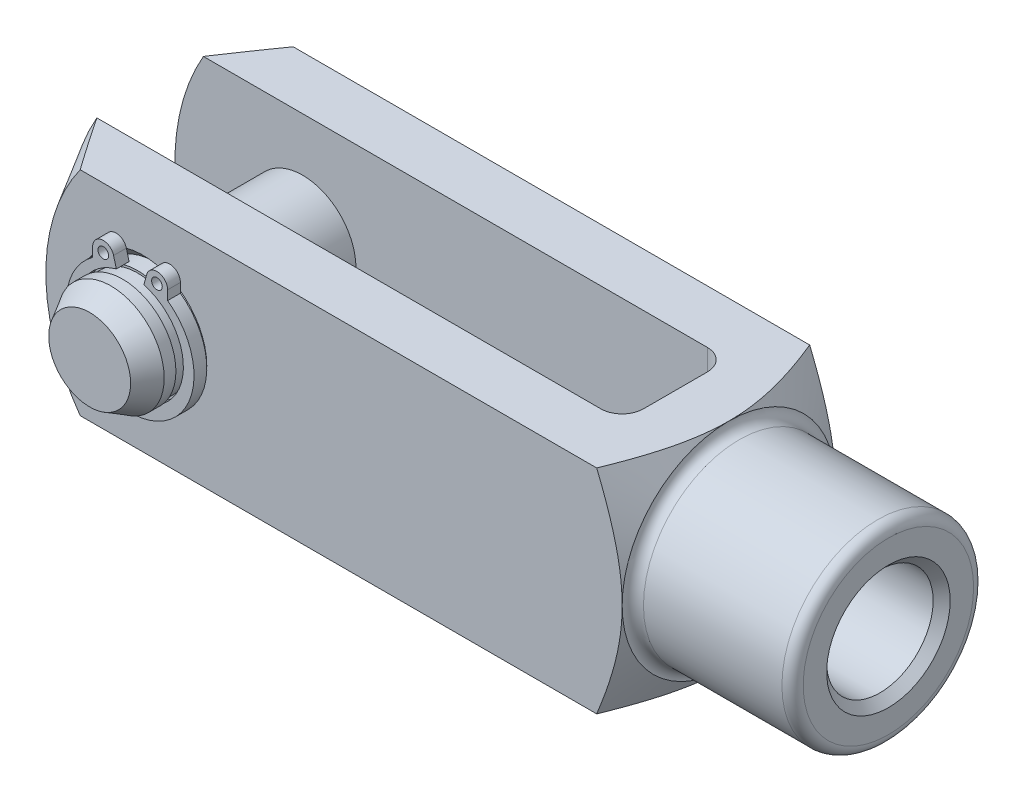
ISO-10303-21;
HEADER;
FILE_DESCRIPTION(('STEP AP214'),'2;1');
FILE_NAME('part.step','',(''),(''),'','','');
FILE_SCHEMA(('AUTOMOTIVE_DESIGN { 1 0 10303 214 1 1 1 1 }'));
ENDSEC;
DATA;
#1=APPLICATION_CONTEXT('core data for automotive mechanical design processes');
#2=APPLICATION_PROTOCOL_DEFINITION('international standard','automotive_design',2000,#1);
#3=PRODUCT_CONTEXT('',#1,'mechanical');
#4=PRODUCT('Part','Part','',(#3));
#5=PRODUCT_RELATED_PRODUCT_CATEGORY('part','',(#4));
#6=PRODUCT_DEFINITION_FORMATION('','',#4);
#7=PRODUCT_DEFINITION_CONTEXT('part definition',#1,'design');
#8=PRODUCT_DEFINITION('design','',#6,#7);
#9=PRODUCT_DEFINITION_SHAPE('','',#8);
#10=(LENGTH_UNIT() NAMED_UNIT(*) SI_UNIT(.MILLI.,.METRE.));
#11=(NAMED_UNIT(*) PLANE_ANGLE_UNIT() SI_UNIT($,.RADIAN.));
#12=(NAMED_UNIT(*) SI_UNIT($,.STERADIAN.) SOLID_ANGLE_UNIT());
#13=UNCERTAINTY_MEASURE_WITH_UNIT(LENGTH_MEASURE(1.E-05),#10,'distance_accuracy_value','');
#14=(GEOMETRIC_REPRESENTATION_CONTEXT(3) GLOBAL_UNCERTAINTY_ASSIGNED_CONTEXT((#13)) GLOBAL_UNIT_ASSIGNED_CONTEXT((#10,
#11,#12)) REPRESENTATION_CONTEXT('',''));
#15=CARTESIAN_POINT('',(0.,0.,0.));
#16=DIRECTION('',(0.,0.,1.));
#17=DIRECTION('',(1.,0.,0.));
#18=AXIS2_PLACEMENT_3D('',#15,#16,#17);
#19=CARTESIAN_POINT('',(-30.,0.,7.5));
#20=DIRECTION('',(0.,0.,-1.));
#21=DIRECTION('',(-1.,0.,0.));
#22=AXIS2_PLACEMENT_3D('',#19,#20,#21);
#23=CYLINDRICAL_SURFACE('',#22,2.5);
#24=CARTESIAN_POINT('',(-30.,0.,5.25));
#25=DIRECTION('',(0.,0.,1.));
#26=DIRECTION('',(1.,0.,0.));
#27=AXIS2_PLACEMENT_3D('',#24,#25,#26);
#28=CIRCLE('',#27,2.5);
#29=CARTESIAN_POINT('',(-27.5,0.,5.25));
#30=VERTEX_POINT('',#29);
#31=EDGE_CURVE('P0_E55',#30,#30,#28,.T.);
#32=ORIENTED_EDGE('',*,*,#31,.F.);
#33=EDGE_LOOP('',(#32));
#34=FACE_BOUND('',#33,.T.);
#35=CARTESIAN_POINT('',(-30.,0.,-5.25));
#36=DIRECTION('',(0.,0.,1.));
#37=DIRECTION('',(1.,0.,0.));
#38=AXIS2_PLACEMENT_3D('',#35,#36,#37);
#39=CIRCLE('',#38,2.5);
#40=CARTESIAN_POINT('',(-27.5,0.,-5.25));
#41=VERTEX_POINT('',#40);
#42=EDGE_CURVE('P0_E40',#41,#41,#39,.T.);
#43=ORIENTED_EDGE('',*,*,#42,.T.);
#44=EDGE_LOOP('',(#43));
#45=FACE_BOUND('',#44,.T.);
#46=ADVANCED_FACE('P0_F14',(#34,#45),#23,.T.);
#47=CARTESIAN_POINT('',(-30.,0.,-5.95));
#48=DIRECTION('',(0.,0.,1.));
#49=DIRECTION('',(1.,0.,0.));
#50=AXIS2_PLACEMENT_3D('',#47,#48,#49);
#51=CIRCLE('',#50,2.5);
#52=CARTESIAN_POINT('',(-27.5,0.,-5.95));
#53=VERTEX_POINT('',#52);
#54=EDGE_CURVE('P0_E43',#53,#53,#51,.T.);
#55=ORIENTED_EDGE('',*,*,#54,.F.);
#56=EDGE_LOOP('',(#55));
#57=FACE_BOUND('',#56,.T.);
#58=CARTESIAN_POINT('',(-30.,0.,-6.5));
#59=DIRECTION('',(0.,0.,1.));
#60=DIRECTION('',(1.,0.,0.));
#61=AXIS2_PLACEMENT_3D('',#58,#59,#60);
#62=CIRCLE('',#61,2.5);
#63=CARTESIAN_POINT('',(-27.5,0.,-6.5));
#64=VERTEX_POINT('',#63);
#65=EDGE_CURVE('P0_E25',#64,#64,#62,.T.);
#66=ORIENTED_EDGE('',*,*,#65,.T.);
#67=EDGE_LOOP('',(#66));
#68=FACE_BOUND('',#67,.T.);
#69=ADVANCED_FACE('P0_F63',(#57,#68),#23,.T.);
#70=CARTESIAN_POINT('',(-30.,0.,-7.5));
#71=DIRECTION('',(0.,0.,1.));
#72=DIRECTION('',(1.,0.,0.));
#73=AXIS2_PLACEMENT_3D('',#70,#71,#72);
#74=PLANE('',#73);
#75=CARTESIAN_POINT('',(-30.,0.,-7.5));
#76=DIRECTION('',(0.,0.,1.));
#77=DIRECTION('',(1.,0.,0.));
#78=AXIS2_PLACEMENT_3D('',#75,#76,#77);
#79=CIRCLE('',#78,1.92264973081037);
#80=CARTESIAN_POINT('',(-28.0773502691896,0.,-7.5));
#81=VERTEX_POINT('',#80);
#82=EDGE_CURVE('P0_E21',#81,#81,#79,.F.);
#83=ORIENTED_EDGE('',*,*,#82,.T.);
#84=EDGE_LOOP('',(#83));
#85=FACE_BOUND('',#84,.T.);
#86=ADVANCED_FACE('P0_F89',(#85),#74,.F.);
#87=CARTESIAN_POINT('',(-30.,0.,-6.5));
#88=DIRECTION('',(0.,0.,1.));
#89=DIRECTION('',(1.,0.,0.));
#90=AXIS2_PLACEMENT_3D('',#87,#88,#89);
#91=CONICAL_SURFACE('',#90,2.5,0.523598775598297);
#92=ORIENTED_EDGE('',*,*,#82,.F.);
#93=EDGE_LOOP('',(#92));
#94=FACE_BOUND('',#93,.T.);
#95=ORIENTED_EDGE('',*,*,#65,.F.);
#96=EDGE_LOOP('',(#95));
#97=FACE_BOUND('',#96,.T.);
#98=ADVANCED_FACE('P0_F83',(#94,#97),#91,.T.);
#99=CARTESIAN_POINT('',(-30.,2.5,-5.95));
#100=DIRECTION('',(0.,0.,-1.));
#101=DIRECTION('',(-1.,0.,0.));
#102=AXIS2_PLACEMENT_3D('',#99,#100,#101);
#103=PLANE('',#102);
#104=CARTESIAN_POINT('',(-30.,0.,-5.95));
#105=DIRECTION('',(0.,0.,1.));
#106=DIRECTION('',(1.,0.,0.));
#107=AXIS2_PLACEMENT_3D('',#104,#105,#106);
#108=CIRCLE('',#107,2.4);
#109=CARTESIAN_POINT('',(-27.6,0.,-5.95));
#110=VERTEX_POINT('',#109);
#111=EDGE_CURVE('P0_E34',#110,#110,#108,.T.);
#112=ORIENTED_EDGE('',*,*,#111,.F.);
#113=EDGE_LOOP('',(#112));
#114=FACE_BOUND('',#113,.T.);
#115=ORIENTED_EDGE('',*,*,#54,.T.);
#116=EDGE_LOOP('',(#115));
#117=FACE_BOUND('',#116,.T.);
#118=ADVANCED_FACE('P0_F77',(#114,#117),#103,.F.);
#119=CARTESIAN_POINT('',(-30.,0.,6.5));
#120=DIRECTION('',(0.,0.,1.));
#121=DIRECTION('',(1.,0.,0.));
#122=AXIS2_PLACEMENT_3D('',#119,#120,#121);
#123=CYLINDRICAL_SURFACE('',#122,2.4);
#124=CARTESIAN_POINT('',(-30.,0.,-5.25));
#125=DIRECTION('',(0.,0.,1.));
#126=DIRECTION('',(1.,0.,0.));
#127=AXIS2_PLACEMENT_3D('',#124,#125,#126);
#128=CIRCLE('',#127,2.4);
#129=CARTESIAN_POINT('',(-27.6,0.,-5.25));
#130=VERTEX_POINT('',#129);
#131=EDGE_CURVE('P0_E37',#130,#130,#128,.T.);
#132=ORIENTED_EDGE('',*,*,#131,.F.);
#133=EDGE_LOOP('',(#132));
#134=FACE_BOUND('',#133,.T.);
#135=ORIENTED_EDGE('',*,*,#111,.T.);
#136=EDGE_LOOP('',(#135));
#137=FACE_BOUND('',#136,.T.);
#138=ADVANCED_FACE('P0_F71',(#134,#137),#123,.T.);
#139=CARTESIAN_POINT('',(-30.,2.5,-5.25));
#140=DIRECTION('',(0.,0.,1.));
#141=DIRECTION('',(1.,0.,0.));
#142=AXIS2_PLACEMENT_3D('',#139,#140,#141);
#143=PLANE('',#142);
#144=ORIENTED_EDGE('',*,*,#42,.F.);
#145=EDGE_LOOP('',(#144));
#146=FACE_BOUND('',#145,.T.);
#147=ORIENTED_EDGE('',*,*,#131,.T.);
#148=EDGE_LOOP('',(#147));
#149=FACE_BOUND('',#148,.T.);
#150=ADVANCED_FACE('P0_F68',(#146,#149),#143,.F.);
#151=CARTESIAN_POINT('',(-30.,2.5,5.25));
#152=DIRECTION('',(0.,0.,-1.));
#153=DIRECTION('',(-1.,0.,0.));
#154=AXIS2_PLACEMENT_3D('',#151,#152,#153);
#155=PLANE('',#154);
#156=CARTESIAN_POINT('',(-30.,0.,5.25));
#157=DIRECTION('',(0.,0.,1.));
#158=DIRECTION('',(1.,0.,0.));
#159=AXIS2_PLACEMENT_3D('',#156,#157,#158);
#160=CIRCLE('',#159,2.4);
#161=CARTESIAN_POINT('',(-27.6,0.,5.25));
#162=VERTEX_POINT('',#161);
#163=EDGE_CURVE('P0_E46',#162,#162,#160,.T.);
#164=ORIENTED_EDGE('',*,*,#163,.F.);
#165=EDGE_LOOP('',(#164));
#166=FACE_BOUND('',#165,.T.);
#167=ORIENTED_EDGE('',*,*,#31,.T.);
#168=EDGE_LOOP('',(#167));
#169=FACE_BOUND('',#168,.T.);
#170=ADVANCED_FACE('P0_F59',(#166,#169),#155,.F.);
#171=CARTESIAN_POINT('',(-30.,0.,6.5));
#172=DIRECTION('',(0.,0.,1.));
#173=DIRECTION('',(1.,0.,0.));
#174=AXIS2_PLACEMENT_3D('',#171,#172,#173);
#175=CYLINDRICAL_SURFACE('',#174,2.4);
#176=CARTESIAN_POINT('',(-30.,0.,5.95));
#177=DIRECTION('',(0.,0.,1.));
#178=DIRECTION('',(1.,0.,0.));
#179=AXIS2_PLACEMENT_3D('',#176,#177,#178);
#180=CIRCLE('',#179,2.4);
#181=CARTESIAN_POINT('',(-27.6,0.,5.95));
#182=VERTEX_POINT('',#181);
#183=EDGE_CURVE('P0_E49',#182,#182,#180,.T.);
#184=ORIENTED_EDGE('',*,*,#183,.F.);
#185=EDGE_LOOP('',(#184));
#186=FACE_BOUND('',#185,.T.);
#187=ORIENTED_EDGE('',*,*,#163,.T.);
#188=EDGE_LOOP('',(#187));
#189=FACE_BOUND('',#188,.T.);
#190=ADVANCED_FACE('P0_F108',(#186,#189),#175,.T.);
#191=CARTESIAN_POINT('',(-30.,2.5,5.95));
#192=DIRECTION('',(0.,0.,1.));
#193=DIRECTION('',(1.,0.,0.));
#194=AXIS2_PLACEMENT_3D('',#191,#192,#193);
#195=PLANE('',#194);
#196=CARTESIAN_POINT('',(-30.,0.,5.95));
#197=DIRECTION('',(0.,0.,1.));
#198=DIRECTION('',(1.,0.,0.));
#199=AXIS2_PLACEMENT_3D('',#196,#197,#198);
#200=CIRCLE('',#199,2.5);
#201=CARTESIAN_POINT('',(-27.5,0.,5.95));
#202=VERTEX_POINT('',#201);
#203=EDGE_CURVE('P0_E52',#202,#202,#200,.T.);
#204=ORIENTED_EDGE('',*,*,#203,.F.);
#205=EDGE_LOOP('',(#204));
#206=FACE_BOUND('',#205,.T.);
#207=ORIENTED_EDGE('',*,*,#183,.T.);
#208=EDGE_LOOP('',(#207));
#209=FACE_BOUND('',#208,.T.);
#210=ADVANCED_FACE('P0_F104',(#206,#209),#195,.F.);
#211=CARTESIAN_POINT('',(-30.,0.,7.5));
#212=DIRECTION('',(0.,0.,1.));
#213=DIRECTION('',(1.,0.,0.));
#214=AXIS2_PLACEMENT_3D('',#211,#212,#213);
#215=PLANE('',#214);
#216=CARTESIAN_POINT('',(-30.,0.,7.5));
#217=DIRECTION('',(0.,0.,1.));
#218=DIRECTION('',(1.,0.,0.));
#219=AXIS2_PLACEMENT_3D('',#216,#217,#218);
#220=CIRCLE('',#219,1.92264973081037);
#221=CARTESIAN_POINT('',(-28.0773502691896,0.,7.5));
#222=VERTEX_POINT('',#221);
#223=EDGE_CURVE('P0_E10',#222,#222,#220,.T.);
#224=ORIENTED_EDGE('',*,*,#223,.T.);
#225=EDGE_LOOP('',(#224));
#226=FACE_BOUND('',#225,.T.);
#227=ADVANCED_FACE('P0_F102',(#226),#215,.T.);
#228=CARTESIAN_POINT('',(-30.,0.,7.5));
#229=DIRECTION('',(0.,0.,-1.));
#230=DIRECTION('',(-1.,0.,0.));
#231=AXIS2_PLACEMENT_3D('',#228,#229,#230);
#232=CONICAL_SURFACE('',#231,1.92264973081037,0.523598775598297);
#233=CARTESIAN_POINT('',(-30.,0.,6.5));
#234=DIRECTION('',(0.,0.,1.));
#235=DIRECTION('',(1.,0.,0.));
#236=AXIS2_PLACEMENT_3D('',#233,#234,#235);
#237=CIRCLE('',#236,2.5);
#238=CARTESIAN_POINT('',(-27.5,0.,6.5));
#239=VERTEX_POINT('',#238);
#240=EDGE_CURVE('P0_E29',#239,#239,#237,.F.);
#241=ORIENTED_EDGE('',*,*,#240,.F.);
#242=EDGE_LOOP('',(#241));
#243=FACE_BOUND('',#242,.T.);
#244=ORIENTED_EDGE('',*,*,#223,.F.);
#245=EDGE_LOOP('',(#244));
#246=FACE_BOUND('',#245,.T.);
#247=ADVANCED_FACE('P0_F16',(#243,#246),#232,.T.);
#248=ORIENTED_EDGE('',*,*,#203,.T.);
#249=EDGE_LOOP('',(#248));
#250=FACE_BOUND('',#249,.T.);
#251=ORIENTED_EDGE('',*,*,#240,.T.);
#252=EDGE_LOOP('',(#251));
#253=FACE_BOUND('',#252,.T.);
#254=ADVANCED_FACE('P0_F65',(#250,#253),#23,.T.);
#255=CLOSED_SHELL('',(#46,#69,#86,#98,#118,#138,#150,#170,#190,#210,#227,#247,#254));
#256=MANIFOLD_SOLID_BREP('P0_B1',#255);
#257=CARTESIAN_POINT('',(-30.,0.,5.59999999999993));
#258=DIRECTION('',(0.,0.,1.));
#259=DIRECTION('',(1.,0.,0.));
#260=AXIS2_PLACEMENT_3D('',#257,#258,#259);
#261=PLANE('',#260);
#262=CARTESIAN_POINT('',(-31.2594200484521,2.76836795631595,5.59999999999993));
#263=DIRECTION('',(0.,0.,1.));
#264=DIRECTION('',(1.,0.,0.));
#265=AXIS2_PLACEMENT_3D('',#262,#263,#264);
#266=CIRCLE('',#265,0.25);
#267=CARTESIAN_POINT('',(-31.0094200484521,2.76836795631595,5.59999999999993));
#268=VERTEX_POINT('',#267);
#269=EDGE_CURVE('P1_E117',#268,#268,#266,.T.);
#270=ORIENTED_EDGE('',*,*,#269,.F.);
#271=EDGE_LOOP('',(#270));
#272=FACE_BOUND('',#271,.T.);
#273=CARTESIAN_POINT('',(-30.,0.,5.59999999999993));
#274=DIRECTION('',(0.,0.,-1.));
#275=DIRECTION('',(1.,0.,0.));
#276=AXIS2_PLACEMENT_3D('',#273,#274,#275);
#277=CIRCLE('',#276,2.5);
#278=CARTESIAN_POINT('',(-29.3529523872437,2.41481456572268,5.59999999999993));
#279=VERTEX_POINT('',#278);
#280=CARTESIAN_POINT('',(-30.6470476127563,2.41481456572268,5.59999999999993));
#281=VERTEX_POINT('',#280);
#282=EDGE_CURVE('P1_E128',#279,#281,#277,.T.);
#283=ORIENTED_EDGE('',*,*,#282,.T.);
#284=DIRECTION('',(-0.258819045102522,0.965925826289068,0.));
#285=VECTOR('',#284,1.);
#286=CARTESIAN_POINT('',(-30.6470476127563,2.41481456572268,5.59999999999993));
#287=LINE('',#286,#285);
#288=CARTESIAN_POINT('',(-30.7764571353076,2.89777747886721,5.59999999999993));
#289=VERTEX_POINT('',#288);
#290=EDGE_CURVE('P1_E76',#281,#289,#287,.T.);
#291=ORIENTED_EDGE('',*,*,#290,.T.);
#292=CARTESIAN_POINT('',(-31.2594200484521,2.76836795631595,5.59999999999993));
#293=DIRECTION('',(0.,0.,1.));
#294=DIRECTION('',(1.,0.,0.));
#295=AXIS2_PLACEMENT_3D('',#292,#293,#294);
#296=CIRCLE('',#295,0.499999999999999);
#297=CARTESIAN_POINT('',(-31.7594200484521,2.76836795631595,5.59999999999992));
#298=VERTEX_POINT('',#297);
#299=EDGE_CURVE('P1_E143',#289,#298,#296,.T.);
#300=ORIENTED_EDGE('',*,*,#299,.T.);
#301=DIRECTION('',(0.,-1.,0.));
#302=VECTOR('',#301,1.);
#303=CARTESIAN_POINT('',(-31.7594200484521,2.76836795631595,5.59999999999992));
#304=LINE('',#303,#302);
#305=CARTESIAN_POINT('',(-31.7594200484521,2.32990557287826,5.59999999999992));
#306=VERTEX_POINT('',#305);
#307=EDGE_CURVE('P1_E156',#298,#306,#304,.T.);
#308=ORIENTED_EDGE('',*,*,#307,.T.);
#309=CARTESIAN_POINT('',(-30.,-0.0999999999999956,5.59999999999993));
#310=DIRECTION('',(0.,0.,1.));
#311=DIRECTION('',(1.,0.,0.));
#312=AXIS2_PLACEMENT_3D('',#309,#310,#311);
#313=CIRCLE('',#312,3.);
#314=CARTESIAN_POINT('',(-28.2405799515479,2.32990557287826,5.59999999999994));
#315=VERTEX_POINT('',#314);
#316=EDGE_CURVE('P1_E95',#306,#315,#313,.T.);
#317=ORIENTED_EDGE('',*,*,#316,.T.);
#318=DIRECTION('',(0.,1.,0.));
#319=VECTOR('',#318,1.);
#320=CARTESIAN_POINT('',(-28.2405799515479,2.76836795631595,5.59999999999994));
#321=LINE('',#320,#319);
#322=CARTESIAN_POINT('',(-28.2405799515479,2.76836795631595,5.59999999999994));
#323=VERTEX_POINT('',#322);
#324=EDGE_CURVE('P1_E89',#315,#323,#321,.T.);
#325=ORIENTED_EDGE('',*,*,#324,.T.);
#326=CARTESIAN_POINT('',(-28.7405799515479,2.76836795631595,5.59999999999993));
#327=DIRECTION('',(0.,0.,1.));
#328=DIRECTION('',(-1.,0.,0.));
#329=AXIS2_PLACEMENT_3D('',#326,#327,#328);
#330=CIRCLE('',#329,0.499999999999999);
#331=CARTESIAN_POINT('',(-29.2235428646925,2.89777747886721,5.59999999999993));
#332=VERTEX_POINT('',#331);
#333=EDGE_CURVE('P1_E93',#323,#332,#330,.T.);
#334=ORIENTED_EDGE('',*,*,#333,.T.);
#335=DIRECTION('',(-0.258819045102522,-0.965925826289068,0.));
#336=VECTOR('',#335,1.);
#337=CARTESIAN_POINT('',(-29.3529523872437,2.41481456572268,5.59999999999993));
#338=LINE('',#337,#336);
#339=EDGE_CURVE('P1_E33',#332,#279,#338,.T.);
#340=ORIENTED_EDGE('',*,*,#339,.T.);
#341=EDGE_LOOP('',(#283,#291,#300,#308,#317,#325,#334,#340));
#342=FACE_BOUND('',#341,.T.);
#343=CARTESIAN_POINT('',(-28.7405799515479,2.76836795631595,5.59999999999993));
#344=DIRECTION('',(0.,0.,1.));
#345=DIRECTION('',(-1.,0.,0.));
#346=AXIS2_PLACEMENT_3D('',#343,#344,#345);
#347=CIRCLE('',#346,0.25);
#348=CARTESIAN_POINT('',(-28.9905799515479,2.76836795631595,5.59999999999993));
#349=VERTEX_POINT('',#348);
#350=EDGE_CURVE('P1_E165',#349,#349,#347,.T.);
#351=ORIENTED_EDGE('',*,*,#350,.F.);
#352=EDGE_LOOP('',(#351));
#353=FACE_BOUND('',#352,.T.);
#354=ADVANCED_FACE('P1_F16',(#272,#342,#353),#261,.T.);
#355=CARTESIAN_POINT('',(-30.,0.,4.99999999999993));
#356=DIRECTION('',(0.,0.,1.));
#357=DIRECTION('',(1.,0.,0.));
#358=AXIS2_PLACEMENT_3D('',#355,#356,#357);
#359=PLANE('',#358);
#360=CARTESIAN_POINT('',(-31.2594200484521,2.76836795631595,4.99999999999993));
#361=DIRECTION('',(0.,0.,1.));
#362=DIRECTION('',(1.,0.,0.));
#363=AXIS2_PLACEMENT_3D('',#360,#361,#362);
#364=CIRCLE('',#363,0.25);
#365=CARTESIAN_POINT('',(-31.0094200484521,2.76836795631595,4.99999999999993));
#366=VERTEX_POINT('',#365);
#367=EDGE_CURVE('P1_E162',#366,#366,#364,.T.);
#368=ORIENTED_EDGE('',*,*,#367,.T.);
#369=EDGE_LOOP('',(#368));
#370=FACE_BOUND('',#369,.T.);
#371=CARTESIAN_POINT('',(-30.,0.,4.99999999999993));
#372=DIRECTION('',(0.,0.,-1.));
#373=DIRECTION('',(1.,0.,0.));
#374=AXIS2_PLACEMENT_3D('',#371,#372,#373);
#375=CIRCLE('',#374,2.5);
#376=CARTESIAN_POINT('',(-29.3529523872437,2.41481456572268,4.99999999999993));
#377=VERTEX_POINT('',#376);
#378=CARTESIAN_POINT('',(-30.6470476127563,2.41481456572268,4.99999999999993));
#379=VERTEX_POINT('',#378);
#380=EDGE_CURVE('P1_E113',#377,#379,#375,.T.);
#381=ORIENTED_EDGE('',*,*,#380,.F.);
#382=DIRECTION('',(-0.258819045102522,-0.965925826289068,0.));
#383=VECTOR('',#382,1.);
#384=CARTESIAN_POINT('',(-29.3529523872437,2.41481456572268,4.99999999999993));
#385=LINE('',#384,#383);
#386=CARTESIAN_POINT('',(-29.2235428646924,2.89777747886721,4.99999999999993));
#387=VERTEX_POINT('',#386);
#388=EDGE_CURVE('P1_E68',#387,#377,#385,.T.);
#389=ORIENTED_EDGE('',*,*,#388,.F.);
#390=CARTESIAN_POINT('',(-28.7405799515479,2.76836795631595,4.99999999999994));
#391=DIRECTION('',(0.,0.,1.));
#392=DIRECTION('',(-1.,0.,0.));
#393=AXIS2_PLACEMENT_3D('',#390,#391,#392);
#394=CIRCLE('',#393,0.499999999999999);
#395=CARTESIAN_POINT('',(-28.2405799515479,2.76836795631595,4.99999999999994));
#396=VERTEX_POINT('',#395);
#397=EDGE_CURVE('P1_E62',#396,#387,#394,.T.);
#398=ORIENTED_EDGE('',*,*,#397,.F.);
#399=DIRECTION('',(0.,1.,0.));
#400=VECTOR('',#399,1.);
#401=CARTESIAN_POINT('',(-28.2405799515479,2.76836795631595,4.99999999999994));
#402=LINE('',#401,#400);
#403=CARTESIAN_POINT('',(-28.2405799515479,2.32990557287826,4.99999999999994));
#404=VERTEX_POINT('',#403);
#405=EDGE_CURVE('P1_E103',#404,#396,#402,.T.);
#406=ORIENTED_EDGE('',*,*,#405,.F.);
#407=CARTESIAN_POINT('',(-30.,-0.0999999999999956,4.99999999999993));
#408=DIRECTION('',(0.,0.,1.));
#409=DIRECTION('',(1.,0.,0.));
#410=AXIS2_PLACEMENT_3D('',#407,#408,#409);
#411=CIRCLE('',#410,3.);
#412=CARTESIAN_POINT('',(-31.7594200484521,2.32990557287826,4.99999999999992));
#413=VERTEX_POINT('',#412);
#414=EDGE_CURVE('P1_E123',#413,#404,#411,.T.);
#415=ORIENTED_EDGE('',*,*,#414,.F.);
#416=DIRECTION('',(0.,-1.,0.));
#417=VECTOR('',#416,1.);
#418=CARTESIAN_POINT('',(-31.7594200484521,2.76836795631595,4.99999999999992));
#419=LINE('',#418,#417);
#420=CARTESIAN_POINT('',(-31.7594200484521,2.76836795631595,4.99999999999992));
#421=VERTEX_POINT('',#420);
#422=EDGE_CURVE('P1_E121',#421,#413,#419,.T.);
#423=ORIENTED_EDGE('',*,*,#422,.F.);
#424=CARTESIAN_POINT('',(-31.2594200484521,2.76836795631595,4.99999999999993));
#425=DIRECTION('',(0.,0.,1.));
#426=DIRECTION('',(1.,0.,0.));
#427=AXIS2_PLACEMENT_3D('',#424,#425,#426);
#428=CIRCLE('',#427,0.499999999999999);
#429=CARTESIAN_POINT('',(-30.7764571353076,2.89777747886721,4.99999999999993));
#430=VERTEX_POINT('',#429);
#431=EDGE_CURVE('P1_E119',#430,#421,#428,.T.);
#432=ORIENTED_EDGE('',*,*,#431,.F.);
#433=DIRECTION('',(-0.258819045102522,0.965925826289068,0.));
#434=VECTOR('',#433,1.);
#435=CARTESIAN_POINT('',(-30.6470476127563,2.41481456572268,4.99999999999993));
#436=LINE('',#435,#434);
#437=EDGE_CURVE('P1_E116',#379,#430,#436,.T.);
#438=ORIENTED_EDGE('',*,*,#437,.F.);
#439=EDGE_LOOP('',(#381,#389,#398,#406,#415,#423,#432,#438));
#440=FACE_BOUND('',#439,.T.);
#441=CARTESIAN_POINT('',(-28.7405799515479,2.76836795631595,4.99999999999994));
#442=DIRECTION('',(0.,0.,1.));
#443=DIRECTION('',(-1.,0.,0.));
#444=AXIS2_PLACEMENT_3D('',#441,#442,#443);
#445=CIRCLE('',#444,0.25);
#446=CARTESIAN_POINT('',(-28.9905799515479,2.76836795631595,4.99999999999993));
#447=VERTEX_POINT('',#446);
#448=EDGE_CURVE('P1_E168',#447,#447,#445,.T.);
#449=ORIENTED_EDGE('',*,*,#448,.T.);
#450=EDGE_LOOP('',(#449));
#451=FACE_BOUND('',#450,.T.);
#452=ADVANCED_FACE('P1_F147',(#370,#440,#451),#359,.F.);
#453=CARTESIAN_POINT('',(-30.,0.,5.59999999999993));
#454=DIRECTION('',(0.,0.,-1.));
#455=DIRECTION('',(-1.,0.,0.));
#456=AXIS2_PLACEMENT_3D('',#453,#454,#455);
#457=CYLINDRICAL_SURFACE('',#456,2.5);
#458=ORIENTED_EDGE('',*,*,#380,.T.);
#459=DIRECTION('',(0.,0.,-1.));
#460=VECTOR('',#459,1.);
#461=CARTESIAN_POINT('',(-30.6470476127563,2.41481456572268,5.59999999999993));
#462=LINE('',#461,#460);
#463=EDGE_CURVE('P1_E11',#281,#379,#462,.T.);
#464=ORIENTED_EDGE('',*,*,#463,.F.);
#465=ORIENTED_EDGE('',*,*,#282,.F.);
#466=DIRECTION('',(0.,0.,-1.));
#467=VECTOR('',#466,1.);
#468=CARTESIAN_POINT('',(-29.3529523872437,2.41481456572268,5.59999999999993));
#469=LINE('',#468,#467);
#470=EDGE_CURVE('P1_E109',#279,#377,#469,.T.);
#471=ORIENTED_EDGE('',*,*,#470,.T.);
#472=EDGE_LOOP('',(#458,#464,#465,#471));
#473=FACE_BOUND('',#472,.T.);
#474=ADVANCED_FACE('P1_F18',(#473),#457,.F.);
#475=CARTESIAN_POINT('',(-30.6470476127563,2.41481456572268,5.59999999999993));
#476=DIRECTION('',(-0.965925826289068,-0.258819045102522,0.));
#477=DIRECTION('',(0.258819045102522,-0.965925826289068,0.));
#478=AXIS2_PLACEMENT_3D('',#475,#476,#477);
#479=PLANE('',#478);
#480=ORIENTED_EDGE('',*,*,#437,.T.);
#481=DIRECTION('',(0.,0.,-1.));
#482=VECTOR('',#481,1.);
#483=CARTESIAN_POINT('',(-30.7764571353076,2.89777747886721,5.59999999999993));
#484=LINE('',#483,#482);
#485=EDGE_CURVE('P1_E25',#289,#430,#484,.T.);
#486=ORIENTED_EDGE('',*,*,#485,.F.);
#487=ORIENTED_EDGE('',*,*,#290,.F.);
#488=ORIENTED_EDGE('',*,*,#463,.T.);
#489=EDGE_LOOP('',(#480,#486,#487,#488));
#490=FACE_BOUND('',#489,.T.);
#491=ADVANCED_FACE('P1_F202',(#490),#479,.F.);
#492=CARTESIAN_POINT('',(-31.2594200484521,2.76836795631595,5.59999999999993));
#493=DIRECTION('',(0.,0.,-1.));
#494=DIRECTION('',(-1.,0.,0.));
#495=AXIS2_PLACEMENT_3D('',#492,#493,#494);
#496=CYLINDRICAL_SURFACE('',#495,0.499999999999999);
#497=ORIENTED_EDGE('',*,*,#431,.T.);
#498=DIRECTION('',(0.,0.,-1.));
#499=VECTOR('',#498,1.);
#500=CARTESIAN_POINT('',(-31.7594200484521,2.76836795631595,5.59999999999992));
#501=LINE('',#500,#499);
#502=EDGE_CURVE('P1_E135',#298,#421,#501,.T.);
#503=ORIENTED_EDGE('',*,*,#502,.F.);
#504=ORIENTED_EDGE('',*,*,#299,.F.);
#505=ORIENTED_EDGE('',*,*,#485,.T.);
#506=EDGE_LOOP('',(#497,#503,#504,#505));
#507=FACE_BOUND('',#506,.T.);
#508=ADVANCED_FACE('P1_F141',(#507),#496,.T.);
#509=CARTESIAN_POINT('',(-31.7594200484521,2.76836795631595,5.59999999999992));
#510=DIRECTION('',(1.,0.,0.));
#511=DIRECTION('',(0.,0.,-1.));
#512=AXIS2_PLACEMENT_3D('',#509,#510,#511);
#513=PLANE('',#512);
#514=ORIENTED_EDGE('',*,*,#422,.T.);
#515=DIRECTION('',(0.,0.,-1.));
#516=VECTOR('',#515,1.);
#517=CARTESIAN_POINT('',(-31.7594200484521,2.32990557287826,5.59999999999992));
#518=LINE('',#517,#516);
#519=EDGE_CURVE('P1_E132',#306,#413,#518,.T.);
#520=ORIENTED_EDGE('',*,*,#519,.F.);
#521=ORIENTED_EDGE('',*,*,#307,.F.);
#522=ORIENTED_EDGE('',*,*,#502,.T.);
#523=EDGE_LOOP('',(#514,#520,#521,#522));
#524=FACE_BOUND('',#523,.T.);
#525=ADVANCED_FACE('P1_F152',(#524),#513,.F.);
#526=CARTESIAN_POINT('',(-30.,-0.0999999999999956,5.59999999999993));
#527=DIRECTION('',(0.,0.,-1.));
#528=DIRECTION('',(-1.,0.,0.));
#529=AXIS2_PLACEMENT_3D('',#526,#527,#528);
#530=CYLINDRICAL_SURFACE('',#529,3.);
#531=ORIENTED_EDGE('',*,*,#414,.T.);
#532=DIRECTION('',(0.,0.,-1.));
#533=VECTOR('',#532,1.);
#534=CARTESIAN_POINT('',(-28.2405799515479,2.32990557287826,5.59999999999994));
#535=LINE('',#534,#533);
#536=EDGE_CURVE('P1_E104',#315,#404,#535,.T.);
#537=ORIENTED_EDGE('',*,*,#536,.F.);
#538=ORIENTED_EDGE('',*,*,#316,.F.);
#539=ORIENTED_EDGE('',*,*,#519,.T.);
#540=EDGE_LOOP('',(#531,#537,#538,#539));
#541=FACE_BOUND('',#540,.T.);
#542=ADVANCED_FACE('P1_F155',(#541),#530,.T.);
#543=CARTESIAN_POINT('',(-28.2405799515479,2.76836795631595,5.59999999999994));
#544=DIRECTION('',(-1.,0.,0.));
#545=DIRECTION('',(0.,0.,1.));
#546=AXIS2_PLACEMENT_3D('',#543,#544,#545);
#547=PLANE('',#546);
#548=ORIENTED_EDGE('',*,*,#405,.T.);
#549=DIRECTION('',(0.,0.,-1.));
#550=VECTOR('',#549,1.);
#551=CARTESIAN_POINT('',(-28.2405799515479,2.76836795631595,5.59999999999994));
#552=LINE('',#551,#550);
#553=EDGE_CURVE('P1_E100',#323,#396,#552,.T.);
#554=ORIENTED_EDGE('',*,*,#553,.F.);
#555=ORIENTED_EDGE('',*,*,#324,.F.);
#556=ORIENTED_EDGE('',*,*,#536,.T.);
#557=EDGE_LOOP('',(#548,#554,#555,#556));
#558=FACE_BOUND('',#557,.T.);
#559=ADVANCED_FACE('P1_F101',(#558),#547,.F.);
#560=CARTESIAN_POINT('',(-28.7405799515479,2.76836795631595,5.59999999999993));
#561=DIRECTION('',(0.,0.,-1.));
#562=DIRECTION('',(-1.,0.,0.));
#563=AXIS2_PLACEMENT_3D('',#560,#561,#562);
#564=CYLINDRICAL_SURFACE('',#563,0.499999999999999);
#565=ORIENTED_EDGE('',*,*,#397,.T.);
#566=DIRECTION('',(0.,0.,-1.));
#567=VECTOR('',#566,1.);
#568=CARTESIAN_POINT('',(-29.2235428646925,2.89777747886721,5.59999999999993));
#569=LINE('',#568,#567);
#570=EDGE_CURVE('P1_E105',#332,#387,#569,.T.);
#571=ORIENTED_EDGE('',*,*,#570,.F.);
#572=ORIENTED_EDGE('',*,*,#333,.F.);
#573=ORIENTED_EDGE('',*,*,#553,.T.);
#574=EDGE_LOOP('',(#565,#571,#572,#573));
#575=FACE_BOUND('',#574,.T.);
#576=ADVANCED_FACE('P1_F107',(#575),#564,.T.);
#577=CARTESIAN_POINT('',(-29.3529523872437,2.41481456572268,5.59999999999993));
#578=DIRECTION('',(0.965925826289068,-0.258819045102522,0.));
#579=DIRECTION('',(0.258819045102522,0.965925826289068,0.));
#580=AXIS2_PLACEMENT_3D('',#577,#578,#579);
#581=PLANE('',#580);
#582=ORIENTED_EDGE('',*,*,#388,.T.);
#583=ORIENTED_EDGE('',*,*,#470,.F.);
#584=ORIENTED_EDGE('',*,*,#339,.F.);
#585=ORIENTED_EDGE('',*,*,#570,.T.);
#586=EDGE_LOOP('',(#582,#583,#584,#585));
#587=FACE_BOUND('',#586,.T.);
#588=ADVANCED_FACE('P1_F190',(#587),#581,.F.);
#589=CARTESIAN_POINT('',(-31.2594200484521,2.76836795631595,5.59999999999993));
#590=DIRECTION('',(0.,0.,-1.));
#591=DIRECTION('',(-1.,0.,0.));
#592=AXIS2_PLACEMENT_3D('',#589,#590,#591);
#593=CYLINDRICAL_SURFACE('',#592,0.25);
#594=ORIENTED_EDGE('',*,*,#269,.T.);
#595=EDGE_LOOP('',(#594));
#596=FACE_BOUND('',#595,.T.);
#597=ORIENTED_EDGE('',*,*,#367,.F.);
#598=EDGE_LOOP('',(#597));
#599=FACE_BOUND('',#598,.T.);
#600=ADVANCED_FACE('P1_F187',(#596,#599),#593,.F.);
#601=CARTESIAN_POINT('',(-28.7405799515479,2.76836795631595,5.59999999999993));
#602=DIRECTION('',(0.,0.,-1.));
#603=DIRECTION('',(-1.,0.,0.));
#604=AXIS2_PLACEMENT_3D('',#601,#602,#603);
#605=CYLINDRICAL_SURFACE('',#604,0.25);
#606=ORIENTED_EDGE('',*,*,#350,.T.);
#607=EDGE_LOOP('',(#606));
#608=FACE_BOUND('',#607,.T.);
#609=ORIENTED_EDGE('',*,*,#448,.F.);
#610=EDGE_LOOP('',(#609));
#611=FACE_BOUND('',#610,.T.);
#612=ADVANCED_FACE('P1_F174',(#608,#611),#605,.F.);
#613=CLOSED_SHELL('',(#354,#452,#474,#491,#508,#525,#542,#559,#576,#588,#600,#612));
#614=MANIFOLD_SOLID_BREP('P1_B1',#613);
#615=CARTESIAN_POINT('',(-30.,0.,-5.59999999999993));
#616=DIRECTION('',(0.,0.,-1.));
#617=DIRECTION('',(-1.,0.,0.));
#618=AXIS2_PLACEMENT_3D('',#615,#616,#617);
#619=PLANE('',#618);
#620=CARTESIAN_POINT('',(-28.7405799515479,2.76836795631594,-5.59999999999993));
#621=DIRECTION('',(0.,0.,-1.));
#622=DIRECTION('',(-1.,0.,0.));
#623=AXIS2_PLACEMENT_3D('',#620,#621,#622);
#624=CIRCLE('',#623,0.25);
#625=CARTESIAN_POINT('',(-28.9905799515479,2.76836795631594,-5.59999999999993));
#626=VERTEX_POINT('',#625);
#627=EDGE_CURVE('P2_E117',#626,#626,#624,.T.);
#628=ORIENTED_EDGE('',*,*,#627,.F.);
#629=EDGE_LOOP('',(#628));
#630=FACE_BOUND('',#629,.T.);
#631=CARTESIAN_POINT('',(-30.,0.,-5.59999999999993));
#632=DIRECTION('',(0.,0.,1.));
#633=DIRECTION('',(-1.,0.,0.));
#634=AXIS2_PLACEMENT_3D('',#631,#632,#633);
#635=CIRCLE('',#634,2.5);
#636=CARTESIAN_POINT('',(-30.6470476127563,2.41481456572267,-5.59999999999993));
#637=VERTEX_POINT('',#636);
#638=CARTESIAN_POINT('',(-29.3529523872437,2.41481456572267,-5.59999999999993));
#639=VERTEX_POINT('',#638);
#640=EDGE_CURVE('P2_E128',#637,#639,#635,.T.);
#641=ORIENTED_EDGE('',*,*,#640,.T.);
#642=DIRECTION('',(0.258819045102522,0.965925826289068,0.));
#643=VECTOR('',#642,1.);
#644=CARTESIAN_POINT('',(-29.3529523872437,2.41481456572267,-5.59999999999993));
#645=LINE('',#644,#643);
#646=CARTESIAN_POINT('',(-29.2235428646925,2.8977774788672,-5.59999999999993));
#647=VERTEX_POINT('',#646);
#648=EDGE_CURVE('P2_E76',#639,#647,#645,.T.);
#649=ORIENTED_EDGE('',*,*,#648,.T.);
#650=CARTESIAN_POINT('',(-28.7405799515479,2.76836795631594,-5.59999999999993));
#651=DIRECTION('',(0.,0.,-1.));
#652=DIRECTION('',(-1.,0.,0.));
#653=AXIS2_PLACEMENT_3D('',#650,#651,#652);
#654=CIRCLE('',#653,0.499999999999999);
#655=CARTESIAN_POINT('',(-28.2405799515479,2.76836795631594,-5.59999999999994));
#656=VERTEX_POINT('',#655);
#657=EDGE_CURVE('P2_E143',#647,#656,#654,.T.);
#658=ORIENTED_EDGE('',*,*,#657,.T.);
#659=DIRECTION('',(0.,-1.,0.));
#660=VECTOR('',#659,1.);
#661=CARTESIAN_POINT('',(-28.2405799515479,2.76836795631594,-5.59999999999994));
#662=LINE('',#661,#660);
#663=CARTESIAN_POINT('',(-28.2405799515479,2.32990557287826,-5.59999999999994));
#664=VERTEX_POINT('',#663);
#665=EDGE_CURVE('P2_E156',#656,#664,#662,.T.);
#666=ORIENTED_EDGE('',*,*,#665,.T.);
#667=CARTESIAN_POINT('',(-30.,-0.100000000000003,-5.59999999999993));
#668=DIRECTION('',(0.,0.,-1.));
#669=DIRECTION('',(-1.,0.,0.));
#670=AXIS2_PLACEMENT_3D('',#667,#668,#669);
#671=CIRCLE('',#670,3.);
#672=CARTESIAN_POINT('',(-31.7594200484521,2.32990557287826,-5.59999999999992));
#673=VERTEX_POINT('',#672);
#674=EDGE_CURVE('P2_E95',#664,#673,#671,.T.);
#675=ORIENTED_EDGE('',*,*,#674,.T.);
#676=DIRECTION('',(0.,1.,0.));
#677=VECTOR('',#676,1.);
#678=CARTESIAN_POINT('',(-31.7594200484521,2.76836795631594,-5.59999999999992));
#679=LINE('',#678,#677);
#680=CARTESIAN_POINT('',(-31.7594200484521,2.76836795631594,-5.59999999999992));
#681=VERTEX_POINT('',#680);
#682=EDGE_CURVE('P2_E89',#673,#681,#679,.T.);
#683=ORIENTED_EDGE('',*,*,#682,.T.);
#684=CARTESIAN_POINT('',(-31.2594200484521,2.76836795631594,-5.59999999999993));
#685=DIRECTION('',(0.,0.,-1.));
#686=DIRECTION('',(1.,0.,0.));
#687=AXIS2_PLACEMENT_3D('',#684,#685,#686);
#688=CIRCLE('',#687,0.499999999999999);
#689=CARTESIAN_POINT('',(-30.7764571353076,2.8977774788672,-5.59999999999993));
#690=VERTEX_POINT('',#689);
#691=EDGE_CURVE('P2_E93',#681,#690,#688,.T.);
#692=ORIENTED_EDGE('',*,*,#691,.T.);
#693=DIRECTION('',(0.258819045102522,-0.965925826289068,0.));
#694=VECTOR('',#693,1.);
#695=CARTESIAN_POINT('',(-30.6470476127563,2.41481456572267,-5.59999999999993));
#696=LINE('',#695,#694);
#697=EDGE_CURVE('P2_E33',#690,#637,#696,.T.);
#698=ORIENTED_EDGE('',*,*,#697,.T.);
#699=EDGE_LOOP('',(#641,#649,#658,#666,#675,#683,#692,#698));
#700=FACE_BOUND('',#699,.T.);
#701=CARTESIAN_POINT('',(-31.2594200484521,2.76836795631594,-5.59999999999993));
#702=DIRECTION('',(0.,0.,-1.));
#703=DIRECTION('',(1.,0.,0.));
#704=AXIS2_PLACEMENT_3D('',#701,#702,#703);
#705=CIRCLE('',#704,0.25);
#706=CARTESIAN_POINT('',(-31.0094200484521,2.76836795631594,-5.59999999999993));
#707=VERTEX_POINT('',#706);
#708=EDGE_CURVE('P2_E165',#707,#707,#705,.T.);
#709=ORIENTED_EDGE('',*,*,#708,.F.);
#710=EDGE_LOOP('',(#709));
#711=FACE_BOUND('',#710,.T.);
#712=ADVANCED_FACE('P2_F16',(#630,#700,#711),#619,.T.);
#713=CARTESIAN_POINT('',(-30.,0.,-4.99999999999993));
#714=DIRECTION('',(0.,0.,-1.));
#715=DIRECTION('',(-1.,0.,0.));
#716=AXIS2_PLACEMENT_3D('',#713,#714,#715);
#717=PLANE('',#716);
#718=CARTESIAN_POINT('',(-28.7405799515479,2.76836795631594,-4.99999999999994));
#719=DIRECTION('',(0.,0.,-1.));
#720=DIRECTION('',(-1.,0.,0.));
#721=AXIS2_PLACEMENT_3D('',#718,#719,#720);
#722=CIRCLE('',#721,0.25);
#723=CARTESIAN_POINT('',(-28.9905799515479,2.76836795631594,-4.99999999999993));
#724=VERTEX_POINT('',#723);
#725=EDGE_CURVE('P2_E162',#724,#724,#722,.T.);
#726=ORIENTED_EDGE('',*,*,#725,.T.);
#727=EDGE_LOOP('',(#726));
#728=FACE_BOUND('',#727,.T.);
#729=CARTESIAN_POINT('',(-30.,0.,-4.99999999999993));
#730=DIRECTION('',(0.,0.,1.));
#731=DIRECTION('',(-1.,0.,0.));
#732=AXIS2_PLACEMENT_3D('',#729,#730,#731);
#733=CIRCLE('',#732,2.5);
#734=CARTESIAN_POINT('',(-30.6470476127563,2.41481456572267,-4.99999999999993));
#735=VERTEX_POINT('',#734);
#736=CARTESIAN_POINT('',(-29.3529523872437,2.41481456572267,-4.99999999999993));
#737=VERTEX_POINT('',#736);
#738=EDGE_CURVE('P2_E113',#735,#737,#733,.T.);
#739=ORIENTED_EDGE('',*,*,#738,.F.);
#740=DIRECTION('',(0.258819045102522,-0.965925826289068,0.));
#741=VECTOR('',#740,1.);
#742=CARTESIAN_POINT('',(-30.6470476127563,2.41481456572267,-4.99999999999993));
#743=LINE('',#742,#741);
#744=CARTESIAN_POINT('',(-30.7764571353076,2.8977774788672,-4.99999999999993));
#745=VERTEX_POINT('',#744);
#746=EDGE_CURVE('P2_E68',#745,#735,#743,.T.);
#747=ORIENTED_EDGE('',*,*,#746,.F.);
#748=CARTESIAN_POINT('',(-31.2594200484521,2.76836795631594,-4.99999999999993));
#749=DIRECTION('',(0.,0.,-1.));
#750=DIRECTION('',(1.,0.,0.));
#751=AXIS2_PLACEMENT_3D('',#748,#749,#750);
#752=CIRCLE('',#751,0.499999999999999);
#753=CARTESIAN_POINT('',(-31.7594200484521,2.76836795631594,-4.99999999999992));
#754=VERTEX_POINT('',#753);
#755=EDGE_CURVE('P2_E62',#754,#745,#752,.T.);
#756=ORIENTED_EDGE('',*,*,#755,.F.);
#757=DIRECTION('',(0.,1.,0.));
#758=VECTOR('',#757,1.);
#759=CARTESIAN_POINT('',(-31.7594200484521,2.76836795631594,-4.99999999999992));
#760=LINE('',#759,#758);
#761=CARTESIAN_POINT('',(-31.7594200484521,2.32990557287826,-4.99999999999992));
#762=VERTEX_POINT('',#761);
#763=EDGE_CURVE('P2_E103',#762,#754,#760,.T.);
#764=ORIENTED_EDGE('',*,*,#763,.F.);
#765=CARTESIAN_POINT('',(-30.,-0.100000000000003,-4.99999999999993));
#766=DIRECTION('',(0.,0.,-1.));
#767=DIRECTION('',(-1.,0.,0.));
#768=AXIS2_PLACEMENT_3D('',#765,#766,#767);
#769=CIRCLE('',#768,3.);
#770=CARTESIAN_POINT('',(-28.2405799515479,2.32990557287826,-4.99999999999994));
#771=VERTEX_POINT('',#770);
#772=EDGE_CURVE('P2_E123',#771,#762,#769,.T.);
#773=ORIENTED_EDGE('',*,*,#772,.F.);
#774=DIRECTION('',(0.,-1.,0.));
#775=VECTOR('',#774,1.);
#776=CARTESIAN_POINT('',(-28.2405799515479,2.76836795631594,-4.99999999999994));
#777=LINE('',#776,#775);
#778=CARTESIAN_POINT('',(-28.2405799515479,2.76836795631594,-4.99999999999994));
#779=VERTEX_POINT('',#778);
#780=EDGE_CURVE('P2_E121',#779,#771,#777,.T.);
#781=ORIENTED_EDGE('',*,*,#780,.F.);
#782=CARTESIAN_POINT('',(-28.7405799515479,2.76836795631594,-4.99999999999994));
#783=DIRECTION('',(0.,0.,-1.));
#784=DIRECTION('',(-1.,0.,0.));
#785=AXIS2_PLACEMENT_3D('',#782,#783,#784);
#786=CIRCLE('',#785,0.499999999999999);
#787=CARTESIAN_POINT('',(-29.2235428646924,2.8977774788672,-4.99999999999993));
#788=VERTEX_POINT('',#787);
#789=EDGE_CURVE('P2_E119',#788,#779,#786,.T.);
#790=ORIENTED_EDGE('',*,*,#789,.F.);
#791=DIRECTION('',(0.258819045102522,0.965925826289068,0.));
#792=VECTOR('',#791,1.);
#793=CARTESIAN_POINT('',(-29.3529523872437,2.41481456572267,-4.99999999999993));
#794=LINE('',#793,#792);
#795=EDGE_CURVE('P2_E116',#737,#788,#794,.T.);
#796=ORIENTED_EDGE('',*,*,#795,.F.);
#797=EDGE_LOOP('',(#739,#747,#756,#764,#773,#781,#790,#796));
#798=FACE_BOUND('',#797,.T.);
#799=CARTESIAN_POINT('',(-31.2594200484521,2.76836795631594,-4.99999999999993));
#800=DIRECTION('',(0.,0.,-1.));
#801=DIRECTION('',(1.,0.,0.));
#802=AXIS2_PLACEMENT_3D('',#799,#800,#801);
#803=CIRCLE('',#802,0.25);
#804=CARTESIAN_POINT('',(-31.0094200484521,2.76836795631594,-4.99999999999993));
#805=VERTEX_POINT('',#804);
#806=EDGE_CURVE('P2_E168',#805,#805,#803,.T.);
#807=ORIENTED_EDGE('',*,*,#806,.T.);
#808=EDGE_LOOP('',(#807));
#809=FACE_BOUND('',#808,.T.);
#810=ADVANCED_FACE('P2_F147',(#728,#798,#809),#717,.F.);
#811=CARTESIAN_POINT('',(-30.,0.,-5.59999999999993));
#812=DIRECTION('',(0.,0.,1.));
#813=DIRECTION('',(1.,0.,0.));
#814=AXIS2_PLACEMENT_3D('',#811,#812,#813);
#815=CYLINDRICAL_SURFACE('',#814,2.5);
#816=ORIENTED_EDGE('',*,*,#738,.T.);
#817=DIRECTION('',(0.,0.,1.));
#818=VECTOR('',#817,1.);
#819=CARTESIAN_POINT('',(-29.3529523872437,2.41481456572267,-5.59999999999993));
#820=LINE('',#819,#818);
#821=EDGE_CURVE('P2_E11',#639,#737,#820,.T.);
#822=ORIENTED_EDGE('',*,*,#821,.F.);
#823=ORIENTED_EDGE('',*,*,#640,.F.);
#824=DIRECTION('',(0.,0.,1.));
#825=VECTOR('',#824,1.);
#826=CARTESIAN_POINT('',(-30.6470476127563,2.41481456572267,-5.59999999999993));
#827=LINE('',#826,#825);
#828=EDGE_CURVE('P2_E109',#637,#735,#827,.T.);
#829=ORIENTED_EDGE('',*,*,#828,.T.);
#830=EDGE_LOOP('',(#816,#822,#823,#829));
#831=FACE_BOUND('',#830,.T.);
#832=ADVANCED_FACE('P2_F18',(#831),#815,.F.);
#833=CARTESIAN_POINT('',(-29.3529523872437,2.41481456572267,-5.59999999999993));
#834=DIRECTION('',(0.965925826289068,-0.258819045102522,0.));
#835=DIRECTION('',(-0.258819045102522,-0.965925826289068,0.));
#836=AXIS2_PLACEMENT_3D('',#833,#834,#835);
#837=PLANE('',#836);
#838=ORIENTED_EDGE('',*,*,#795,.T.);
#839=DIRECTION('',(0.,0.,1.));
#840=VECTOR('',#839,1.);
#841=CARTESIAN_POINT('',(-29.2235428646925,2.8977774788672,-5.59999999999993));
#842=LINE('',#841,#840);
#843=EDGE_CURVE('P2_E25',#647,#788,#842,.T.);
#844=ORIENTED_EDGE('',*,*,#843,.F.);
#845=ORIENTED_EDGE('',*,*,#648,.F.);
#846=ORIENTED_EDGE('',*,*,#821,.T.);
#847=EDGE_LOOP('',(#838,#844,#845,#846));
#848=FACE_BOUND('',#847,.T.);
#849=ADVANCED_FACE('P2_F202',(#848),#837,.F.);
#850=CARTESIAN_POINT('',(-28.7405799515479,2.76836795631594,-5.59999999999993));
#851=DIRECTION('',(0.,0.,1.));
#852=DIRECTION('',(1.,0.,0.));
#853=AXIS2_PLACEMENT_3D('',#850,#851,#852);
#854=CYLINDRICAL_SURFACE('',#853,0.499999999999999);
#855=ORIENTED_EDGE('',*,*,#789,.T.);
#856=DIRECTION('',(0.,0.,1.));
#857=VECTOR('',#856,1.);
#858=CARTESIAN_POINT('',(-28.2405799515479,2.76836795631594,-5.59999999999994));
#859=LINE('',#858,#857);
#860=EDGE_CURVE('P2_E135',#656,#779,#859,.T.);
#861=ORIENTED_EDGE('',*,*,#860,.F.);
#862=ORIENTED_EDGE('',*,*,#657,.F.);
#863=ORIENTED_EDGE('',*,*,#843,.T.);
#864=EDGE_LOOP('',(#855,#861,#862,#863));
#865=FACE_BOUND('',#864,.T.);
#866=ADVANCED_FACE('P2_F141',(#865),#854,.T.);
#867=CARTESIAN_POINT('',(-28.2405799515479,2.76836795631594,-5.59999999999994));
#868=DIRECTION('',(-1.,0.,0.));
#869=DIRECTION('',(0.,0.,1.));
#870=AXIS2_PLACEMENT_3D('',#867,#868,#869);
#871=PLANE('',#870);
#872=ORIENTED_EDGE('',*,*,#780,.T.);
#873=DIRECTION('',(0.,0.,1.));
#874=VECTOR('',#873,1.);
#875=CARTESIAN_POINT('',(-28.2405799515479,2.32990557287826,-5.59999999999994));
#876=LINE('',#875,#874);
#877=EDGE_CURVE('P2_E132',#664,#771,#876,.T.);
#878=ORIENTED_EDGE('',*,*,#877,.F.);
#879=ORIENTED_EDGE('',*,*,#665,.F.);
#880=ORIENTED_EDGE('',*,*,#860,.T.);
#881=EDGE_LOOP('',(#872,#878,#879,#880));
#882=FACE_BOUND('',#881,.T.);
#883=ADVANCED_FACE('P2_F152',(#882),#871,.F.);
#884=CARTESIAN_POINT('',(-30.,-0.100000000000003,-5.59999999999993));
#885=DIRECTION('',(0.,0.,1.));
#886=DIRECTION('',(1.,0.,0.));
#887=AXIS2_PLACEMENT_3D('',#884,#885,#886);
#888=CYLINDRICAL_SURFACE('',#887,3.);
#889=ORIENTED_EDGE('',*,*,#772,.T.);
#890=DIRECTION('',(0.,0.,1.));
#891=VECTOR('',#890,1.);
#892=CARTESIAN_POINT('',(-31.7594200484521,2.32990557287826,-5.59999999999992));
#893=LINE('',#892,#891);
#894=EDGE_CURVE('P2_E104',#673,#762,#893,.T.);
#895=ORIENTED_EDGE('',*,*,#894,.F.);
#896=ORIENTED_EDGE('',*,*,#674,.F.);
#897=ORIENTED_EDGE('',*,*,#877,.T.);
#898=EDGE_LOOP('',(#889,#895,#896,#897));
#899=FACE_BOUND('',#898,.T.);
#900=ADVANCED_FACE('P2_F155',(#899),#888,.T.);
#901=CARTESIAN_POINT('',(-31.7594200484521,2.76836795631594,-5.59999999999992));
#902=DIRECTION('',(1.,0.,0.));
#903=DIRECTION('',(0.,0.,-1.));
#904=AXIS2_PLACEMENT_3D('',#901,#902,#903);
#905=PLANE('',#904);
#906=ORIENTED_EDGE('',*,*,#763,.T.);
#907=DIRECTION('',(0.,0.,1.));
#908=VECTOR('',#907,1.);
#909=CARTESIAN_POINT('',(-31.7594200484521,2.76836795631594,-5.59999999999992));
#910=LINE('',#909,#908);
#911=EDGE_CURVE('P2_E100',#681,#754,#910,.T.);
#912=ORIENTED_EDGE('',*,*,#911,.F.);
#913=ORIENTED_EDGE('',*,*,#682,.F.);
#914=ORIENTED_EDGE('',*,*,#894,.T.);
#915=EDGE_LOOP('',(#906,#912,#913,#914));
#916=FACE_BOUND('',#915,.T.);
#917=ADVANCED_FACE('P2_F101',(#916),#905,.F.);
#918=CARTESIAN_POINT('',(-31.2594200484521,2.76836795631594,-5.59999999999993));
#919=DIRECTION('',(0.,0.,1.));
#920=DIRECTION('',(1.,0.,0.));
#921=AXIS2_PLACEMENT_3D('',#918,#919,#920);
#922=CYLINDRICAL_SURFACE('',#921,0.499999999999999);
#923=ORIENTED_EDGE('',*,*,#755,.T.);
#924=DIRECTION('',(0.,0.,1.));
#925=VECTOR('',#924,1.);
#926=CARTESIAN_POINT('',(-30.7764571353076,2.8977774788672,-5.59999999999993));
#927=LINE('',#926,#925);
#928=EDGE_CURVE('P2_E105',#690,#745,#927,.T.);
#929=ORIENTED_EDGE('',*,*,#928,.F.);
#930=ORIENTED_EDGE('',*,*,#691,.F.);
#931=ORIENTED_EDGE('',*,*,#911,.T.);
#932=EDGE_LOOP('',(#923,#929,#930,#931));
#933=FACE_BOUND('',#932,.T.);
#934=ADVANCED_FACE('P2_F107',(#933),#922,.T.);
#935=CARTESIAN_POINT('',(-30.6470476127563,2.41481456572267,-5.59999999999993));
#936=DIRECTION('',(-0.965925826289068,-0.258819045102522,0.));
#937=DIRECTION('',(-0.258819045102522,0.965925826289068,0.));
#938=AXIS2_PLACEMENT_3D('',#935,#936,#937);
#939=PLANE('',#938);
#940=ORIENTED_EDGE('',*,*,#746,.T.);
#941=ORIENTED_EDGE('',*,*,#828,.F.);
#942=ORIENTED_EDGE('',*,*,#697,.F.);
#943=ORIENTED_EDGE('',*,*,#928,.T.);
#944=EDGE_LOOP('',(#940,#941,#942,#943));
#945=FACE_BOUND('',#944,.T.);
#946=ADVANCED_FACE('P2_F190',(#945),#939,.F.);
#947=CARTESIAN_POINT('',(-28.7405799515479,2.76836795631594,-5.59999999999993));
#948=DIRECTION('',(0.,0.,1.));
#949=DIRECTION('',(1.,0.,0.));
#950=AXIS2_PLACEMENT_3D('',#947,#948,#949);
#951=CYLINDRICAL_SURFACE('',#950,0.25);
#952=ORIENTED_EDGE('',*,*,#627,.T.);
#953=EDGE_LOOP('',(#952));
#954=FACE_BOUND('',#953,.T.);
#955=ORIENTED_EDGE('',*,*,#725,.F.);
#956=EDGE_LOOP('',(#955));
#957=FACE_BOUND('',#956,.T.);
#958=ADVANCED_FACE('P2_F187',(#954,#957),#951,.F.);
#959=CARTESIAN_POINT('',(-31.2594200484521,2.76836795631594,-5.59999999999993));
#960=DIRECTION('',(0.,0.,1.));
#961=DIRECTION('',(1.,0.,0.));
#962=AXIS2_PLACEMENT_3D('',#959,#960,#961);
#963=CYLINDRICAL_SURFACE('',#962,0.25);
#964=ORIENTED_EDGE('',*,*,#708,.T.);
#965=EDGE_LOOP('',(#964));
#966=FACE_BOUND('',#965,.T.);
#967=ORIENTED_EDGE('',*,*,#806,.F.);
#968=EDGE_LOOP('',(#967));
#969=FACE_BOUND('',#968,.T.);
#970=ADVANCED_FACE('P2_F174',(#966,#969),#963,.F.);
#971=CLOSED_SHELL('',(#712,#810,#832,#849,#866,#883,#900,#917,#934,#946,#958,#970));
#972=MANIFOLD_SOLID_BREP('P2_B1',#971);
#973=CARTESIAN_POINT('',(-11.,-5.,-1.49999999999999));
#974=DIRECTION('',(0.,-1.,0.));
#975=DIRECTION('',(0.,0.,-1.));
#976=AXIS2_PLACEMENT_3D('',#973,#974,#975);
#977=CYLINDRICAL_SURFACE('',#976,1.);
#978=DIRECTION('',(0.,1.,0.));
#979=VECTOR('',#978,1.);
#980=CARTESIAN_POINT('',(-9.99999999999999,-5.,-1.49999999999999));
#981=LINE('',#980,#979);
#982=CARTESIAN_POINT('',(-9.99999999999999,-2.00000000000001,-1.49999999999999));
#983=VERTEX_POINT('',#982);
#984=CARTESIAN_POINT('',(-9.99999999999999,-5.,-1.49999999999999));
#985=VERTEX_POINT('',#984);
#986=EDGE_CURVE('P3_E306',#983,#985,#981,.F.);
#987=ORIENTED_EDGE('',*,*,#986,.F.);
#988=CARTESIAN_POINT('',(-9.99999999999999,-2.00000000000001,-1.49999999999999));
#989=CARTESIAN_POINT('',(-10.0000040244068,-1.97434871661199,-1.53421120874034));
#990=CARTESIAN_POINT('',(-10.0017545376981,-1.94783623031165,-1.56772297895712));
#991=CARTESIAN_POINT('',(-10.0083551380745,-1.89333893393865,-1.63311650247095));
#992=CARTESIAN_POINT('',(-10.0131998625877,-1.86535674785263,-1.66500097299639));
#993=CARTESIAN_POINT('',(-10.0316746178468,-1.7800086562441,-1.75742787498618));
#994=CARTESIAN_POINT('',(-10.0492612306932,-1.72072597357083,-1.81542638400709));
#995=CARTESIAN_POINT('',(-10.1015919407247,-1.57251315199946,-1.9469916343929));
#996=CARTESIAN_POINT('',(-10.1404500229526,-1.4816780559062,-2.01671959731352));
#997=CARTESIAN_POINT('',(-10.2290989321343,-1.2947669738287,-2.14156776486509));
#998=CARTESIAN_POINT('',(-10.2789555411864,-1.19866218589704,-2.19659547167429));
#999=CARTESIAN_POINT('',(-10.3701258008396,-1.03200593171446,-2.27834958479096));
#1000=CARTESIAN_POINT('',(-10.4096778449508,-0.962194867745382,-2.30864712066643));
#1001=CARTESIAN_POINT('',(-10.4913965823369,-0.821458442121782,-2.36238926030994));
#1002=CARTESIAN_POINT('',(-10.5335644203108,-0.750532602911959,-2.38583083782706));
#1003=CARTESIAN_POINT('',(-10.6625948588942,-0.536940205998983,-2.44613120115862));
#1004=CARTESIAN_POINT('',(-10.7522192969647,-0.393043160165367,-2.47316437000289));
#1005=CARTESIAN_POINT('',(-10.8932818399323,-0.168755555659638,-2.49559347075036));
#1006=CARTESIAN_POINT('',(-10.9439640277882,-0.0886013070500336,-2.49971490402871));
#1007=CARTESIAN_POINT('',(-10.9964365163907,-0.00563435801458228,-2.49999523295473));
#1008=CARTESIAN_POINT('',(-10.998218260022,-0.00281717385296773,-2.49999999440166));
#1009=CARTESIAN_POINT('',(-11.,0.,-2.49999999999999));
#1010=B_SPLINE_CURVE_WITH_KNOTS('',3,(#988,#989,#990,#991,#992,#993,#994,#995,#996,#997,#998,
#999,#1000,#1001,#1002,#1003,#1004,#1005,#1006,#1007,#1008,#1009),.UNSPECIFIED.,.F.,.F.,(4,2,2,
2,2,2,2,2,2,2,4),(0.,0.128161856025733,0.256102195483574,0.509450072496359,0.870315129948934,
1.23340004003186,1.49037285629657,1.74745893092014,2.26009785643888,2.54460067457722,
2.55460068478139),.UNSPECIFIED.);
#1011=CARTESIAN_POINT('',(-11.,0.,-2.49999999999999));
#1012=VERTEX_POINT('',#1011);
#1013=EDGE_CURVE('P3_E329',#983,#1012,#1010,.T.);
#1014=ORIENTED_EDGE('',*,*,#1013,.T.);
#1015=DIRECTION('',(0.,1.,0.));
#1016=VECTOR('',#1015,1.);
#1017=CARTESIAN_POINT('',(-11.,5.,-2.49999999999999));
#1018=LINE('',#1017,#1016);
#1019=CARTESIAN_POINT('',(-11.,-5.,-2.49999999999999));
#1020=VERTEX_POINT('',#1019);
#1021=EDGE_CURVE('P3_E153',#1020,#1012,#1018,.T.);
#1022=ORIENTED_EDGE('',*,*,#1021,.F.);
#1023=CARTESIAN_POINT('',(-11.,-5.,-1.49999999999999));
#1024=DIRECTION('',(0.,-1.,0.));
#1025=DIRECTION('',(0.,0.,-1.));
#1026=AXIS2_PLACEMENT_3D('',#1023,#1024,#1025);
#1027=CIRCLE('',#1026,1.);
#1028=EDGE_CURVE('P3_E164',#985,#1020,#1027,.F.);
#1029=ORIENTED_EDGE('',*,*,#1028,.F.);
#1030=EDGE_LOOP('',(#987,#1014,#1022,#1029));
#1031=FACE_BOUND('',#1030,.T.);
#1032=ADVANCED_FACE('P3_F15',(#1031),#977,.F.);
#1033=CARTESIAN_POINT('',(-9.99999999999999,-5.,-2.49999999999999));
#1034=DIRECTION('',(1.,0.,0.));
#1035=DIRECTION('',(0.,0.,-1.));
#1036=AXIS2_PLACEMENT_3D('',#1033,#1034,#1035);
#1037=PLANE('',#1036);
#1038=CARTESIAN_POINT('',(-9.99999999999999,5.,-1.49999999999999));
#1039=VERTEX_POINT('',#1038);
#1040=CARTESIAN_POINT('',(-9.99999999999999,2.00000000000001,-1.49999999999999));
#1041=VERTEX_POINT('',#1040);
#1042=EDGE_CURVE('P3_E317',#1039,#1041,#981,.F.);
#1043=ORIENTED_EDGE('',*,*,#1042,.T.);
#1044=CARTESIAN_POINT('',(-9.99999999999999,0.,0.));
#1045=DIRECTION('',(1.,0.,0.));
#1046=DIRECTION('',(0.,0.,-1.));
#1047=AXIS2_PLACEMENT_3D('',#1044,#1045,#1046);
#1048=CIRCLE('',#1047,2.5);
#1049=CARTESIAN_POINT('',(-9.99999999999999,2.00000000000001,1.49999999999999));
#1050=VERTEX_POINT('',#1049);
#1051=EDGE_CURVE('P3_E379',#1041,#1050,#1048,.T.);
#1052=ORIENTED_EDGE('',*,*,#1051,.T.);
#1053=DIRECTION('',(0.,1.,0.));
#1054=VECTOR('',#1053,1.);
#1055=CARTESIAN_POINT('',(-9.99999999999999,5.,1.49999999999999));
#1056=LINE('',#1055,#1054);
#1057=CARTESIAN_POINT('',(-9.99999999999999,5.,1.49999999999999));
#1058=VERTEX_POINT('',#1057);
#1059=EDGE_CURVE('P3_E136',#1050,#1058,#1056,.T.);
#1060=ORIENTED_EDGE('',*,*,#1059,.T.);
#1061=DIRECTION('',(0.,0.,-1.));
#1062=VECTOR('',#1061,1.);
#1063=CARTESIAN_POINT('',(-9.99999999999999,5.,-2.49999999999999));
#1064=LINE('',#1063,#1062);
#1065=EDGE_CURVE('P3_E292',#1058,#1039,#1064,.T.);
#1066=ORIENTED_EDGE('',*,*,#1065,.T.);
#1067=EDGE_LOOP('',(#1043,#1052,#1060,#1066));
#1068=FACE_BOUND('',#1067,.T.);
#1069=ADVANCED_FACE('P3_F374',(#1068),#1037,.F.);
#1070=CARTESIAN_POINT('',(-11.,-5.,1.49999999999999));
#1071=DIRECTION('',(0.,-1.,0.));
#1072=DIRECTION('',(0.,0.,-1.));
#1073=AXIS2_PLACEMENT_3D('',#1070,#1071,#1072);
#1074=CYLINDRICAL_SURFACE('',#1073,1.);
#1075=ORIENTED_EDGE('',*,*,#1059,.F.);
#1076=CARTESIAN_POINT('',(-9.99999999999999,2.00000000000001,1.49999999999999));
#1077=CARTESIAN_POINT('',(-10.0000040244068,1.97434871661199,1.53421120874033));
#1078=CARTESIAN_POINT('',(-10.0017545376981,1.94783623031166,1.56772297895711));
#1079=CARTESIAN_POINT('',(-10.0083551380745,1.89333893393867,1.63311650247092));
#1080=CARTESIAN_POINT('',(-10.0131998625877,1.86535674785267,1.66500097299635));
#1081=CARTESIAN_POINT('',(-10.0316746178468,1.78000865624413,1.75742787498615));
#1082=CARTESIAN_POINT('',(-10.0492612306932,1.72072597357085,1.81542638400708));
#1083=CARTESIAN_POINT('',(-10.1015919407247,1.57251315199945,1.94699163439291));
#1084=CARTESIAN_POINT('',(-10.1404500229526,1.48167805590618,2.01671959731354));
#1085=CARTESIAN_POINT('',(-10.2290989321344,1.29476697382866,2.14156776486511));
#1086=CARTESIAN_POINT('',(-10.2789555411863,1.198662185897,2.1965954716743));
#1087=CARTESIAN_POINT('',(-10.3701258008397,1.03200593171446,2.27834958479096));
#1088=CARTESIAN_POINT('',(-10.4096778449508,0.962194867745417,2.30864712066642));
#1089=CARTESIAN_POINT('',(-10.4913965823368,0.821458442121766,2.36238926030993));
#1090=CARTESIAN_POINT('',(-10.5335644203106,0.750532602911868,2.38583083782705));
#1091=CARTESIAN_POINT('',(-10.6625948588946,0.536940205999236,2.44613120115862));
#1092=CARTESIAN_POINT('',(-10.7522192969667,0.393043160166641,2.47316437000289));
#1093=CARTESIAN_POINT('',(-10.8932818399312,0.168755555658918,2.49559347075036));
#1094=CARTESIAN_POINT('',(-10.9439640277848,0.0886013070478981,2.4997149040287));
#1095=CARTESIAN_POINT('',(-10.9964365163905,0.00563435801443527,2.49999523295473));
#1096=CARTESIAN_POINT('',(-10.9982182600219,0.00281717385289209,2.49999999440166));
#1097=CARTESIAN_POINT('',(-11.,0.,2.5));
#1098=B_SPLINE_CURVE_WITH_KNOTS('',3,(#1076,#1077,#1078,#1079,#1080,#1081,#1082,#1083,#1084,
#1085,#1086,#1087,#1088,#1089,#1090,#1091,#1092,#1093,#1094,#1095,#1096,#1097),.UNSPECIFIED.,
.F.,.F.,(4,2,2,2,2,2,2,2,2,2,4),(0.,0.1281618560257,0.256102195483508,0.509450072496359,
0.870315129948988,1.23340004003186,1.49037285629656,1.74745893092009,2.26009785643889,
2.54460067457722,2.55460068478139),.UNSPECIFIED.);
#1099=CARTESIAN_POINT('',(-11.,0.,2.5));
#1100=VERTEX_POINT('',#1099);
#1101=EDGE_CURVE('P3_E122',#1050,#1100,#1098,.T.);
#1102=ORIENTED_EDGE('',*,*,#1101,.T.);
#1103=DIRECTION('',(0.,1.,0.));
#1104=VECTOR('',#1103,1.);
#1105=CARTESIAN_POINT('',(-11.,-5.,2.49999999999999));
#1106=LINE('',#1105,#1104);
#1107=CARTESIAN_POINT('',(-11.,5.,2.49999999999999));
#1108=VERTEX_POINT('',#1107);
#1109=EDGE_CURVE('P3_E135',#1108,#1100,#1106,.F.);
#1110=ORIENTED_EDGE('',*,*,#1109,.F.);
#1111=CARTESIAN_POINT('',(-11.,5.,1.49999999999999));
#1112=DIRECTION('',(0.,1.,0.));
#1113=DIRECTION('',(0.,0.,1.));
#1114=AXIS2_PLACEMENT_3D('',#1111,#1112,#1113);
#1115=CIRCLE('',#1114,1.);
#1116=EDGE_CURVE('P3_E159',#1058,#1108,#1115,.F.);
#1117=ORIENTED_EDGE('',*,*,#1116,.F.);
#1118=EDGE_LOOP('',(#1075,#1102,#1110,#1117));
#1119=FACE_BOUND('',#1118,.T.);
#1120=ADVANCED_FACE('P3_F132',(#1119),#1074,.F.);
#1121=CARTESIAN_POINT('',(-36.,-5.,-2.49999999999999));
#1122=DIRECTION('',(0.,0.,-1.));
#1123=DIRECTION('',(-1.,0.,0.));
#1124=AXIS2_PLACEMENT_3D('',#1121,#1122,#1123);
#1125=PLANE('',#1124);
#1126=CARTESIAN_POINT('',(-30.,0.,-2.49999999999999));
#1127=DIRECTION('',(0.,0.,-1.));
#1128=DIRECTION('',(-1.,0.,0.));
#1129=AXIS2_PLACEMENT_3D('',#1126,#1127,#1128);
#1130=CIRCLE('',#1129,2.5);
#1131=CARTESIAN_POINT('',(-32.5,0.,-2.49999999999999));
#1132=VERTEX_POINT('',#1131);
#1133=EDGE_CURVE('P3_E313',#1132,#1132,#1130,.F.);
#1134=ORIENTED_EDGE('',*,*,#1133,.F.);
#1135=EDGE_LOOP('',(#1134));
#1136=FACE_BOUND('',#1135,.T.);
#1137=CARTESIAN_POINT('',(-26.,0.,-2.49999999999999));
#1138=DIRECTION('',(0.,0.,1.));
#1139=DIRECTION('',(1.,0.,0.));
#1140=AXIS2_PLACEMENT_3D('',#1137,#1138,#1139);
#1141=CIRCLE('',#1140,10.);
#1142=CARTESIAN_POINT('',(-34.6602540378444,5.,-2.49999999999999));
#1143=VERTEX_POINT('',#1142);
#1144=CARTESIAN_POINT('',(-34.6602540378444,-5.,-2.49999999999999));
#1145=VERTEX_POINT('',#1144);
#1146=EDGE_CURVE('P3_E234',#1143,#1145,#1141,.T.);
#1147=ORIENTED_EDGE('',*,*,#1146,.T.);
#1148=DIRECTION('',(-1.,0.,0.));
#1149=VECTOR('',#1148,1.);
#1150=CARTESIAN_POINT('',(-36.,-5.,-2.49999999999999));
#1151=LINE('',#1150,#1149);
#1152=EDGE_CURVE('P3_E288',#1020,#1145,#1151,.T.);
#1153=ORIENTED_EDGE('',*,*,#1152,.F.);
#1154=ORIENTED_EDGE('',*,*,#1021,.T.);
#1155=CARTESIAN_POINT('',(-11.,5.,-2.49999999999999));
#1156=VERTEX_POINT('',#1155);
#1157=EDGE_CURVE('P3_E152',#1012,#1156,#1018,.T.);
#1158=ORIENTED_EDGE('',*,*,#1157,.T.);
#1159=DIRECTION('',(-1.,0.,0.));
#1160=VECTOR('',#1159,1.);
#1161=CARTESIAN_POINT('',(-36.,5.,-2.49999999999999));
#1162=LINE('',#1161,#1160);
#1163=EDGE_CURVE('P3_E298',#1156,#1143,#1162,.T.);
#1164=ORIENTED_EDGE('',*,*,#1163,.T.);
#1165=EDGE_LOOP('',(#1147,#1153,#1154,#1158,#1164));
#1166=FACE_BOUND('',#1165,.T.);
#1167=ADVANCED_FACE('P3_F332',(#1136,#1166),#1125,.F.);
#1168=CARTESIAN_POINT('',(-36.,-5.,2.5));
#1169=DIRECTION('',(0.,0.,1.));
#1170=DIRECTION('',(1.,0.,0.));
#1171=AXIS2_PLACEMENT_3D('',#1168,#1169,#1170);
#1172=PLANE('',#1171);
#1173=CARTESIAN_POINT('',(-30.,0.,2.5));
#1174=DIRECTION('',(0.,0.,1.));
#1175=DIRECTION('',(1.,0.,0.));
#1176=AXIS2_PLACEMENT_3D('',#1173,#1174,#1175);
#1177=CIRCLE('',#1176,2.5);
#1178=CARTESIAN_POINT('',(-27.5,0.,2.5));
#1179=VERTEX_POINT('',#1178);
#1180=EDGE_CURVE('P3_E297',#1179,#1179,#1177,.F.);
#1181=ORIENTED_EDGE('',*,*,#1180,.F.);
#1182=EDGE_LOOP('',(#1181));
#1183=FACE_BOUND('',#1182,.T.);
#1184=DIRECTION('',(1.,0.,0.));
#1185=VECTOR('',#1184,1.);
#1186=CARTESIAN_POINT('',(-36.,-5.,2.5));
#1187=LINE('',#1186,#1185);
#1188=CARTESIAN_POINT('',(-34.6602540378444,-5.,2.5));
#1189=VERTEX_POINT('',#1188);
#1190=CARTESIAN_POINT('',(-11.,-5.,2.49999999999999));
#1191=VERTEX_POINT('',#1190);
#1192=EDGE_CURVE('P3_E291',#1189,#1191,#1187,.T.);
#1193=ORIENTED_EDGE('',*,*,#1192,.F.);
#1194=CARTESIAN_POINT('',(-26.,0.,2.5));
#1195=DIRECTION('',(0.,0.,1.));
#1196=DIRECTION('',(1.,0.,0.));
#1197=AXIS2_PLACEMENT_3D('',#1194,#1195,#1196);
#1198=CIRCLE('',#1197,10.);
#1199=CARTESIAN_POINT('',(-34.6602540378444,5.,2.5));
#1200=VERTEX_POINT('',#1199);
#1201=EDGE_CURVE('P3_E370',#1200,#1189,#1198,.T.);
#1202=ORIENTED_EDGE('',*,*,#1201,.F.);
#1203=DIRECTION('',(1.,0.,0.));
#1204=VECTOR('',#1203,1.);
#1205=CARTESIAN_POINT('',(-36.,5.,2.5));
#1206=LINE('',#1205,#1204);
#1207=EDGE_CURVE('P3_E150',#1200,#1108,#1206,.T.);
#1208=ORIENTED_EDGE('',*,*,#1207,.T.);
#1209=ORIENTED_EDGE('',*,*,#1109,.T.);
#1210=EDGE_CURVE('P3_E139',#1100,#1191,#1106,.F.);
#1211=ORIENTED_EDGE('',*,*,#1210,.T.);
#1212=EDGE_LOOP('',(#1193,#1202,#1208,#1209,#1211));
#1213=FACE_BOUND('',#1212,.T.);
#1214=ADVANCED_FACE('P3_F147',(#1183,#1213),#1172,.F.);
#1215=CARTESIAN_POINT('',(-36.,-5.,5.));
#1216=DIRECTION('',(0.,0.,1.));
#1217=DIRECTION('',(1.,0.,0.));
#1218=AXIS2_PLACEMENT_3D('',#1215,#1216,#1217);
#1219=PLANE('',#1218);
#1220=CARTESIAN_POINT('',(-30.,0.,5.));
#1221=DIRECTION('',(0.,0.,1.));
#1222=DIRECTION('',(1.,0.,0.));
#1223=AXIS2_PLACEMENT_3D('',#1220,#1221,#1222);
#1224=CIRCLE('',#1223,3.);
#1225=CARTESIAN_POINT('',(-27.,0.,5.));
#1226=VERTEX_POINT('',#1225);
#1227=EDGE_CURVE('P3_E195',#1226,#1226,#1224,.F.);
#1228=ORIENTED_EDGE('',*,*,#1227,.T.);
#1229=EDGE_LOOP('',(#1228));
#1230=FACE_BOUND('',#1229,.T.);
#1231=DIRECTION('',(1.,0.,0.));
#1232=VECTOR('',#1231,1.);
#1233=CARTESIAN_POINT('',(-36.,5.,5.));
#1234=LINE('',#1233,#1232);
#1235=CARTESIAN_POINT('',(-32.9437612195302,5.,5.));
#1236=VERTEX_POINT('',#1235);
#1237=CARTESIAN_POINT('',(-8.69573155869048,5.,5.));
#1238=VERTEX_POINT('',#1237);
#1239=EDGE_CURVE('P3_E311',#1236,#1238,#1234,.T.);
#1240=ORIENTED_EDGE('',*,*,#1239,.F.);
#1241=CARTESIAN_POINT('',(-26.,0.,5.));
#1242=DIRECTION('',(0.,0.,1.));
#1243=DIRECTION('',(1.,0.,0.));
#1244=AXIS2_PLACEMENT_3D('',#1241,#1242,#1243);
#1245=CIRCLE('',#1244,8.55662432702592);
#1246=CARTESIAN_POINT('',(-32.9437612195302,-5.,5.));
#1247=VERTEX_POINT('',#1246);
#1248=EDGE_CURVE('P3_E38',#1236,#1247,#1245,.T.);
#1249=ORIENTED_EDGE('',*,*,#1248,.T.);
#1250=DIRECTION('',(1.,0.,0.));
#1251=VECTOR('',#1250,1.);
#1252=CARTESIAN_POINT('',(-36.,-5.,5.));
#1253=LINE('',#1252,#1251);
#1254=CARTESIAN_POINT('',(-8.69573155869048,-5.,5.));
#1255=VERTEX_POINT('',#1254);
#1256=EDGE_CURVE('P3_E309',#1247,#1255,#1253,.T.);
#1257=ORIENTED_EDGE('',*,*,#1256,.T.);
#1258=CARTESIAN_POINT('',(-11.1779367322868,-10.2120217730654,5.));
#1259=CARTESIAN_POINT('',(-11.0501732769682,-9.96559184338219,5.));
#1260=CARTESIAN_POINT('',(-10.9230852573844,-9.71880849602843,5.));
#1261=CARTESIAN_POINT('',(-10.6706182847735,-9.22435307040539,5.));
#1262=CARTESIAN_POINT('',(-10.5452394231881,-8.97668094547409,5.));
#1263=CARTESIAN_POINT('',(-10.2963461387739,-8.47986010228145,5.));
#1264=CARTESIAN_POINT('',(-10.1728353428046,-8.23070956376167,5.));
#1265=CARTESIAN_POINT('',(-9.92841321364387,-7.73114008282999,5.));
#1266=CARTESIAN_POINT('',(-9.80750183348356,-7.48072116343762,5.));
#1267=CARTESIAN_POINT('',(-9.56160218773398,-6.96287579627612,5.));
#1268=CARTESIAN_POINT('',(-9.43682075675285,-6.69535084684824,5.));
#1269=CARTESIAN_POINT('',(-9.19200723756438,-6.15811043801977,5.));
#1270=CARTESIAN_POINT('',(-9.07197539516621,-5.88839486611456,5.));
#1271=CARTESIAN_POINT('',(-8.8382236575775,-5.34637384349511,5.));
#1272=CARTESIAN_POINT('',(-8.72450095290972,-5.07406960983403,5.));
#1273=CARTESIAN_POINT('',(-8.50540502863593,-4.5261205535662,5.));
#1274=CARTESIAN_POINT('',(-8.40003081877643,-4.25047613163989,5.));
#1275=CARTESIAN_POINT('',(-8.23962651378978,-3.80384985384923,5.));
#1276=CARTESIAN_POINT('',(-8.18103937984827,-3.63414725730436,5.));
#1277=CARTESIAN_POINT('',(-8.06890917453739,-3.2930890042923,5.));
#1278=CARTESIAN_POINT('',(-8.01536567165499,-3.12173349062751,5.));
#1279=CARTESIAN_POINT('',(-7.91431435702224,-2.77724742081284,5.));
#1280=CARTESIAN_POINT('',(-7.86680629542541,-2.60411693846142,5.));
#1281=CARTESIAN_POINT('',(-7.77895823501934,-2.2560245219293,5.));
#1282=CARTESIAN_POINT('',(-7.73861845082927,-2.08106253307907,5.));
#1283=CARTESIAN_POINT('',(-7.66717141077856,-1.73351278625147,5.));
#1284=CARTESIAN_POINT('',(-7.63587016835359,-1.56096530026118,5.));
#1285=CARTESIAN_POINT('',(-7.58237487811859,-1.21448473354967,5.));
#1286=CARTESIAN_POINT('',(-7.56017887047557,-1.04055195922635,5.));
#1287=CARTESIAN_POINT('',(-7.52581186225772,-0.691784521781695,5.));
#1288=CARTESIAN_POINT('',(-7.5136352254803,-0.516950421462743,5.));
#1289=CARTESIAN_POINT('',(-7.49984755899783,-0.166864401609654,5.));
#1290=CARTESIAN_POINT('',(-7.49823615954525,0.0083875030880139,5.));
#1291=CARTESIAN_POINT('',(-7.50538143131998,0.345895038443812,5.));
#1292=CARTESIAN_POINT('',(-7.51339117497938,0.508167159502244,5.));
#1293=CARTESIAN_POINT('',(-7.5382276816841,0.832028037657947,5.));
#1294=CARTESIAN_POINT('',(-7.55505442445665,0.993616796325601,5.));
#1295=CARTESIAN_POINT('',(-7.59690806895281,1.31580153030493,5.));
#1296=CARTESIAN_POINT('',(-7.62193920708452,1.47639694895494,5.));
#1297=CARTESIAN_POINT('',(-7.67937635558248,1.79625495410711,5.));
#1298=CARTESIAN_POINT('',(-7.71178257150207,1.95551750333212,5.));
#1299=CARTESIAN_POINT('',(-7.78410006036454,2.27716431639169,5.));
#1300=CARTESIAN_POINT('',(-7.82420141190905,2.43950551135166,5.));
#1301=CARTESIAN_POINT('',(-7.91029090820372,2.76260917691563,5.));
#1302=CARTESIAN_POINT('',(-7.95627910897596,2.9233716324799,5.));
#1303=CARTESIAN_POINT('',(-8.05325217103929,3.24336572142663,5.));
#1304=CARTESIAN_POINT('',(-8.10423680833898,3.40259742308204,5.));
#1305=CARTESIAN_POINT('',(-8.21042325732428,3.71963213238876,5.));
#1306=CARTESIAN_POINT('',(-8.26562484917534,3.87743521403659,5.));
#1307=CARTESIAN_POINT('',(-8.38422548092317,4.20455781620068,5.));
#1308=CARTESIAN_POINT('',(-8.44792594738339,4.37376771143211,5.));
#1309=CARTESIAN_POINT('',(-8.57878961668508,4.71084645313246,5.));
#1310=CARTESIAN_POINT('',(-8.64595298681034,4.87871523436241,5.));
#1311=CARTESIAN_POINT('',(-8.85177672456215,5.38062019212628,5.));
#1312=CARTESIAN_POINT('',(-8.99474620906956,5.71288883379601,5.));
#1313=CARTESIAN_POINT('',(-9.28888284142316,6.37408373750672,5.));
#1314=CARTESIAN_POINT('',(-9.44005700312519,6.70300684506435,5.));
#1315=CARTESIAN_POINT('',(-9.7482557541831,7.35804934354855,5.));
#1316=CARTESIAN_POINT('',(-9.90527972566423,7.68416902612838,5.));
#1317=CARTESIAN_POINT('',(-10.2241567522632,8.33526441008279,5.));
#1318=CARTESIAN_POINT('',(-10.3860230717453,8.66023359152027,5.));
#1319=CARTESIAN_POINT('',(-10.7130699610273,9.30850558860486,5.));
#1320=CARTESIAN_POINT('',(-10.8782506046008,9.63180836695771,5.));
#1321=CARTESIAN_POINT('',(-11.2110861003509,10.2769312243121,5.));
#1322=CARTESIAN_POINT('',(-11.3787396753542,10.5987519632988,5.));
#1323=CARTESIAN_POINT('',(-11.716060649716,11.2413369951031,5.));
#1324=CARTESIAN_POINT('',(-11.8857280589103,11.5621012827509,5.));
#1325=CARTESIAN_POINT('',(-12.3464966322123,12.427966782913,5.));
#1326=CARTESIAN_POINT('',(-12.6391179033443,12.9722587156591,5.));
#1327=CARTESIAN_POINT('',(-13.2276625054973,14.0591501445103,5.));
#1328=CARTESIAN_POINT('',(-13.5235862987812,14.6017493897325,5.));
#1329=CARTESIAN_POINT('',(-14.1161130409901,15.6825374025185,5.));
#1330=CARTESIAN_POINT('',(-14.4127023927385,16.2207336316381,5.));
#1331=CARTESIAN_POINT('',(-15.0076407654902,17.296041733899,5.));
#1332=CARTESIAN_POINT('',(-15.3059895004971,17.8331537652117,5.));
#1333=CARTESIAN_POINT('',(-15.6049680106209,18.3699124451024,5.));
#1334=B_SPLINE_CURVE_WITH_KNOTS('',3,(#1258,#1259,#1260,#1261,#1262,#1263,#1264,#1265,#1266,
#1267,#1268,#1269,#1270,#1271,#1272,#1273,#1274,#1275,#1276,#1277,#1278,#1279,#1280,#1281,#1282,
#1283,#1284,#1285,#1286,#1287,#1288,#1289,#1290,#1291,#1292,#1293,#1294,#1295,#1296,#1297,#1298,
#1299,#1300,#1301,#1302,#1303,#1304,#1305,#1306,#1307,#1308,#1309,#1310,#1311,#1312,#1313,#1314,
#1315,#1316,#1317,#1318,#1319,#1320,#1321,#1322,#1323,#1324,#1325,#1326,#1327,#1328,#1329,#1330,
#1331,#1332,#1333),.UNSPECIFIED.,.F.,.F.,(4,2,2,2,2,2,2,2,2,2,2,2,2,2,2,2,2,2,2,2,2,2,2,2,2,2,2,
2,2,2,2,2,2,2,2,2,2,4),(0.,0.832746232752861,1.66553684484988,2.49977764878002,3.33400336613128,
4.21955297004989,5.10514834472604,5.99034614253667,6.87543878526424,7.41396978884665,
7.95245467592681,8.49091726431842,9.02939597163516,9.55527179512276,10.0810343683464,
10.606500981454,11.1319492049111,11.6191099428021,12.1062695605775,12.5936811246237,
13.081106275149,13.5826395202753,14.0841775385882,14.5856930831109,15.0871825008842,
15.6295449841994,16.1719336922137,17.2569226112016,18.3428541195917,19.4286712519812,
20.517799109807,21.6069512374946,22.6955592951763,23.78417267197,25.6380502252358,
27.4921906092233,29.3357115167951,31.1789405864),.UNSPECIFIED.);
#1335=CARTESIAN_POINT('',(-7.5,0.,5.));
#1336=VERTEX_POINT('',#1335);
#1337=EDGE_CURVE('P3_E261',#1336,#1255,#1334,.F.);
#1338=ORIENTED_EDGE('',*,*,#1337,.F.);
#1339=EDGE_CURVE('P3_E259',#1238,#1336,#1334,.F.);
#1340=ORIENTED_EDGE('',*,*,#1339,.F.);
#1341=EDGE_LOOP('',(#1240,#1249,#1257,#1338,#1340));
#1342=FACE_BOUND('',#1341,.T.);
#1343=ADVANCED_FACE('P3_F245',(#1230,#1342),#1219,.T.);
#1344=CARTESIAN_POINT('',(-36.,-5.,5.));
#1345=DIRECTION('',(0.,-1.,0.));
#1346=DIRECTION('',(0.,0.,-1.));
#1347=AXIS2_PLACEMENT_3D('',#1344,#1345,#1346);
#1348=PLANE('',#1347);
#1349=ORIENTED_EDGE('',*,*,#1152,.T.);
#1350=CARTESIAN_POINT('',(-38.6161570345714,-5.,3.68485843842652));
#1351=CARTESIAN_POINT('',(-38.3728735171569,-5.,3.29314977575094));
#1352=CARTESIAN_POINT('',(-38.1289237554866,-5.,2.90185301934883));
#1353=CARTESIAN_POINT('',(-37.6393799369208,-5.,2.12027873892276));
#1354=CARTESIAN_POINT('',(-37.3937858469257,-5.,1.7300012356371));
#1355=CARTESIAN_POINT('',(-36.9003569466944,-5.,0.950211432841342));
#1356=CARTESIAN_POINT('',(-36.6525198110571,-5.,0.560700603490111));
#1357=CARTESIAN_POINT('',(-36.1544780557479,-5.,-0.216801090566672));
#1358=CARTESIAN_POINT('',(-35.9042734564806,-5.,-0.604791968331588));
#1359=CARTESIAN_POINT('',(-35.3904709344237,-5.,-1.3950046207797));
#1360=CARTESIAN_POINT('',(-35.1267492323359,-5.,-1.79714601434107));
#1361=CARTESIAN_POINT('',(-34.5953246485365,-5.,-2.59878951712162));
#1362=CARTESIAN_POINT('',(-34.3276218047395,-5.,-2.99829165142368));
#1363=CARTESIAN_POINT('',(-33.7872819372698,-5.,-3.79351799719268));
#1364=CARTESIAN_POINT('',(-33.5146487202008,-5.,-4.1892447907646));
#1365=CARTESIAN_POINT('',(-32.9626344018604,-5.,-4.97595833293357));
#1366=CARTESIAN_POINT('',(-32.6832536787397,-5.,-5.36694534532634));
#1367=CARTESIAN_POINT('',(-32.2585707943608,-5.,-5.94654587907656));
#1368=CARTESIAN_POINT('',(-32.1167558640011,-5.,-6.13771436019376));
#1369=CARTESIAN_POINT('',(-31.8304276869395,-5.,-6.51801720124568));
#1370=CARTESIAN_POINT('',(-31.6859145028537,-5.,-6.70715160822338));
#1371=CARTESIAN_POINT('',(-31.3934623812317,-5.,-7.08318222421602));
#1372=CARTESIAN_POINT('',(-31.245518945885,-5.,-7.27007494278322));
#1373=CARTESIAN_POINT('',(-30.9457328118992,-5.,-7.64069985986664));
#1374=CARTESIAN_POINT('',(-30.7938903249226,-5.,-7.82443222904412));
#1375=CARTESIAN_POINT('',(-30.4870234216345,-5.,-8.18596657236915));
#1376=CARTESIAN_POINT('',(-30.3320483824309,-5.,-8.3638103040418));
#1377=CARTESIAN_POINT('',(-30.0162560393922,-5.,-8.71434786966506));
#1378=CARTESIAN_POINT('',(-29.8554372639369,-5.,-8.88704038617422));
#1379=CARTESIAN_POINT('',(-29.5268930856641,-5.,-9.22500913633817));
#1380=CARTESIAN_POINT('',(-29.3591840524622,-5.,-9.39030119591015));
#1381=CARTESIAN_POINT('',(-29.0146658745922,-5.,-9.71104872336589));
#1382=CARTESIAN_POINT('',(-28.8378629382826,-5.,-9.86651074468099));
#1383=CARTESIAN_POINT('',(-28.5607263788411,-5.,-10.0916231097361));
#1384=CARTESIAN_POINT('',(-28.4646388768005,-5.,-10.1664975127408));
#1385=CARTESIAN_POINT('',(-28.2689237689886,-5.,-10.3115375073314));
#1386=CARTESIAN_POINT('',(-28.1692954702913,-5.,-10.381702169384));
#1387=CARTESIAN_POINT('',(-27.9662036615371,-5.,-10.5161269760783));
#1388=CARTESIAN_POINT('',(-27.8627432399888,-5.,-10.5803917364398));
#1389=CARTESIAN_POINT('',(-27.6516728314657,-5.,-10.7016113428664));
#1390=CARTESIAN_POINT('',(-27.5440639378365,-5.,-10.7585680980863));
#1391=CARTESIAN_POINT('',(-27.2646742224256,-5.,-10.8919682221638));
#1392=CARTESIAN_POINT('',(-27.0897644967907,-5.,-10.9622087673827));
#1393=CARTESIAN_POINT('',(-26.8207698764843,-5.,-11.0456804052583));
#1394=CARTESIAN_POINT('',(-26.7300249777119,-5.,-11.069852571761));
#1395=CARTESIAN_POINT('',(-26.5467659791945,-5.,-11.1100471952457));
#1396=CARTESIAN_POINT('',(-26.4542528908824,-5.,-11.1260741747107));
#1397=CARTESIAN_POINT('',(-26.2671601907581,-5.,-11.1494213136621));
#1398=CARTESIAN_POINT('',(-26.172569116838,-5.,-11.1566505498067));
#1399=CARTESIAN_POINT('',(-25.9831348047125,-5.,-11.1617580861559));
#1400=CARTESIAN_POINT('',(-25.8882915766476,-5.,-11.159636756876));
#1401=CARTESIAN_POINT('',(-25.6992539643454,-5.,-11.1461448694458));
#1402=CARTESIAN_POINT('',(-25.6050597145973,-5.,-11.1347724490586));
#1403=CARTESIAN_POINT('',(-25.4181469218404,-5.,-11.1033021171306));
#1404=CARTESIAN_POINT('',(-25.3254286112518,-5.,-11.0832028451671));
#1405=CARTESIAN_POINT('',(-25.1250906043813,-5.,-11.0306393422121));
#1406=CARTESIAN_POINT('',(-25.0178926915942,-5.,-10.9965741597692));
#1407=CARTESIAN_POINT('',(-24.8069839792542,-5.,-10.9189382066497));
#1408=CARTESIAN_POINT('',(-24.7032751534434,-5.,-10.8753621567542));
#1409=CARTESIAN_POINT('',(-24.4992757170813,-5.,-10.7801830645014));
#1410=CARTESIAN_POINT('',(-24.3989959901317,-5.,-10.7285569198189));
#1411=CARTESIAN_POINT('',(-24.2021050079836,-5.,-10.6188116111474));
#1412=CARTESIAN_POINT('',(-24.1054933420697,-5.,-10.5606931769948));
#1413=CARTESIAN_POINT('',(-23.8845388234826,-5.,-10.4192139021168));
#1414=CARTESIAN_POINT('',(-23.76149757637,-5.,-10.3338274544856));
#1415=CARTESIAN_POINT('',(-23.5206980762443,-5.,-10.1558693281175));
#1416=CARTESIAN_POINT('',(-23.4029423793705,-5.,-10.063294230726));
#1417=CARTESIAN_POINT('',(-23.1718232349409,-5.,-9.87240526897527));
#1418=CARTESIAN_POINT('',(-23.0584686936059,-5.,-9.77408068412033));
#1419=CARTESIAN_POINT('',(-22.8357596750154,-5.,-9.57306098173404));
#1420=CARTESIAN_POINT('',(-22.7264045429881,-5.,-9.47036658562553));
#1421=CARTESIAN_POINT('',(-22.5103906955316,-5.,-9.2607759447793));
#1422=CARTESIAN_POINT('',(-22.4037548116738,-5.,-9.15385625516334));
#1423=CARTESIAN_POINT('',(-22.1934548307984,-5.,-8.93712706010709));
#1424=CARTESIAN_POINT('',(-22.0897909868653,-5.,-8.8273173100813));
#1425=CARTESIAN_POINT('',(-21.7828585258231,-5.,-8.49460182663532));
#1426=CARTESIAN_POINT('',(-21.5834078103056,-5.,-8.2681714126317));
#1427=CARTESIAN_POINT('',(-21.2495908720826,-5.,-7.87611763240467));
#1428=CARTESIAN_POINT('',(-21.1132838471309,-5.,-7.7121253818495));
#1429=CARTESIAN_POINT('',(-20.8438776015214,-5.,-7.38147097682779));
#1430=CARTESIAN_POINT('',(-20.7107790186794,-5.,-7.21480830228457));
#1431=CARTESIAN_POINT('',(-20.4493181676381,-5.,-6.8819232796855));
#1432=CARTESIAN_POINT('',(-20.3209145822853,-5.,-6.71573326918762));
#1433=CARTESIAN_POINT('',(-20.0664074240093,-5.,-6.38167969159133));
#1434=CARTESIAN_POINT('',(-19.9403031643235,-5.,-6.21381664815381));
#1435=CARTESIAN_POINT('',(-19.8151415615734,-5.,-6.04526137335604));
#1436=B_SPLINE_CURVE_WITH_KNOTS('',3,(#1350,#1351,#1352,#1353,#1354,#1355,#1356,#1357,#1358,
#1359,#1360,#1361,#1362,#1363,#1364,#1365,#1366,#1367,#1368,#1369,#1370,#1371,#1372,#1373,#1374,
#1375,#1376,#1377,#1378,#1379,#1380,#1381,#1382,#1383,#1384,#1385,#1386,#1387,#1388,#1389,#1390,
#1391,#1392,#1393,#1394,#1395,#1396,#1397,#1398,#1399,#1400,#1401,#1402,#1403,#1404,#1405,#1406,
#1407,#1408,#1409,#1410,#1411,#1412,#1413,#1414,#1415,#1416,#1417,#1418,#1419,#1420,#1421,#1422,
#1423,#1424,#1425,#1426,#1427,#1428,#1429,#1430,#1431,#1432,#1433,#1434,#1435),.UNSPECIFIED.,
.F.,.F.,(4,2,2,2,2,2,2,2,2,2,2,2,2,2,2,2,2,2,2,2,2,2,2,2,2,2,2,2,2,2,2,2,2,2,2,2,2,2,2,2,2,2,4),
(0.,1.38333209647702,2.76669212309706,4.15170397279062,5.53670389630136,6.97939224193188,
8.42206685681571,9.86367153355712,11.3051956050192,12.0192581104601,12.7333040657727,
13.4483461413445,14.1633494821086,14.8709323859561,15.5786947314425,16.2848631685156,
16.9905557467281,17.3558886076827,17.7212933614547,18.086409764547,18.4514305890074,
19.0145750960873,19.2959979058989,19.5772642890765,19.8614134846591,20.145551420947,
20.4297465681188,20.7139860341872,21.0508866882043,21.3879748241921,21.7260487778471,
22.0640847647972,22.5130303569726,22.9621907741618,23.4122171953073,23.8621696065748,
24.3151211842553,24.7681112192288,25.6730749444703,26.3127741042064,26.9525994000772,
27.5826270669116,28.2124633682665),.UNSPECIFIED.);
#1437=CARTESIAN_POINT('',(-32.9437612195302,-5.,-5.));
#1438=VERTEX_POINT('',#1437);
#1439=EDGE_CURVE('P3_E233',#1145,#1438,#1436,.T.);
#1440=ORIENTED_EDGE('',*,*,#1439,.T.);
#1441=DIRECTION('',(1.,0.,0.));
#1442=VECTOR('',#1441,1.);
#1443=CARTESIAN_POINT('',(-36.,-5.,-5.));
#1444=LINE('',#1443,#1442);
#1445=CARTESIAN_POINT('',(-8.69573155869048,-5.,-5.));
#1446=VERTEX_POINT('',#1445);
#1447=EDGE_CURVE('P3_E307',#1438,#1446,#1444,.T.);
#1448=ORIENTED_EDGE('',*,*,#1447,.T.);
#1449=CARTESIAN_POINT('',(-11.1779367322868,-5.,-10.2120217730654));
#1450=CARTESIAN_POINT('',(-11.0501732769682,-5.,-9.96559184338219));
#1451=CARTESIAN_POINT('',(-10.9230852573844,-5.,-9.71880849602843));
#1452=CARTESIAN_POINT('',(-10.6706182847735,-5.,-9.22435307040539));
#1453=CARTESIAN_POINT('',(-10.5452394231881,-5.,-8.97668094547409));
#1454=CARTESIAN_POINT('',(-10.2963461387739,-5.,-8.47986010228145));
#1455=CARTESIAN_POINT('',(-10.1728353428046,-5.,-8.23070956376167));
#1456=CARTESIAN_POINT('',(-9.92841321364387,-5.,-7.73114008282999));
#1457=CARTESIAN_POINT('',(-9.80750183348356,-5.,-7.48072116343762));
#1458=CARTESIAN_POINT('',(-9.56160218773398,-5.,-6.96287579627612));
#1459=CARTESIAN_POINT('',(-9.43682075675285,-5.,-6.69535084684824));
#1460=CARTESIAN_POINT('',(-9.19200723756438,-5.,-6.15811043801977));
#1461=CARTESIAN_POINT('',(-9.07197539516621,-5.,-5.88839486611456));
#1462=CARTESIAN_POINT('',(-8.8382236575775,-5.,-5.34637384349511));
#1463=CARTESIAN_POINT('',(-8.72450095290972,-5.,-5.07406960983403));
#1464=CARTESIAN_POINT('',(-8.50540502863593,-5.,-4.5261205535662));
#1465=CARTESIAN_POINT('',(-8.40003081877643,-5.,-4.25047613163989));
#1466=CARTESIAN_POINT('',(-8.23962651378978,-5.,-3.80384985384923));
#1467=CARTESIAN_POINT('',(-8.18103937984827,-5.,-3.63414725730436));
#1468=CARTESIAN_POINT('',(-8.06890917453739,-5.,-3.2930890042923));
#1469=CARTESIAN_POINT('',(-8.01536567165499,-5.,-3.12173349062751));
#1470=CARTESIAN_POINT('',(-7.91431435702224,-5.,-2.77724742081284));
#1471=CARTESIAN_POINT('',(-7.86680629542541,-5.,-2.60411693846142));
#1472=CARTESIAN_POINT('',(-7.77895823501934,-5.,-2.2560245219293));
#1473=CARTESIAN_POINT('',(-7.73861845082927,-5.,-2.08106253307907));
#1474=CARTESIAN_POINT('',(-7.66717141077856,-5.,-1.73351278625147));
#1475=CARTESIAN_POINT('',(-7.63587016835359,-5.,-1.56096530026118));
#1476=CARTESIAN_POINT('',(-7.58237487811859,-5.,-1.21448473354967));
#1477=CARTESIAN_POINT('',(-7.56017887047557,-5.,-1.04055195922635));
#1478=CARTESIAN_POINT('',(-7.52581186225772,-5.,-0.691784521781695));
#1479=CARTESIAN_POINT('',(-7.5136352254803,-5.,-0.516950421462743));
#1480=CARTESIAN_POINT('',(-7.49984755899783,-5.,-0.166864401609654));
#1481=CARTESIAN_POINT('',(-7.49823615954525,-5.,0.0083875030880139));
#1482=CARTESIAN_POINT('',(-7.50538143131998,-5.,0.345895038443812));
#1483=CARTESIAN_POINT('',(-7.51339117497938,-5.,0.508167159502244));
#1484=CARTESIAN_POINT('',(-7.5382276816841,-5.,0.832028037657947));
#1485=CARTESIAN_POINT('',(-7.55505442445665,-5.,0.993616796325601));
#1486=CARTESIAN_POINT('',(-7.59690806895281,-5.,1.31580153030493));
#1487=CARTESIAN_POINT('',(-7.62193920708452,-5.,1.47639694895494));
#1488=CARTESIAN_POINT('',(-7.67937635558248,-5.,1.79625495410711));
#1489=CARTESIAN_POINT('',(-7.71178257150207,-5.,1.95551750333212));
#1490=CARTESIAN_POINT('',(-7.78410006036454,-5.,2.27716431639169));
#1491=CARTESIAN_POINT('',(-7.82420141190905,-5.,2.43950551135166));
#1492=CARTESIAN_POINT('',(-7.91029090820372,-5.,2.76260917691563));
#1493=CARTESIAN_POINT('',(-7.95627910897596,-5.,2.9233716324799));
#1494=CARTESIAN_POINT('',(-8.05325217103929,-5.,3.24336572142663));
#1495=CARTESIAN_POINT('',(-8.10423680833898,-5.,3.40259742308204));
#1496=CARTESIAN_POINT('',(-8.21042325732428,-5.,3.71963213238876));
#1497=CARTESIAN_POINT('',(-8.26562484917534,-5.,3.87743521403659));
#1498=CARTESIAN_POINT('',(-8.38422548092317,-5.,4.20455781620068));
#1499=CARTESIAN_POINT('',(-8.44792594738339,-5.,4.37376771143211));
#1500=CARTESIAN_POINT('',(-8.57878961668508,-5.,4.71084645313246));
#1501=CARTESIAN_POINT('',(-8.64595298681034,-5.,4.87871523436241));
#1502=CARTESIAN_POINT('',(-8.85177672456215,-5.,5.38062019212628));
#1503=CARTESIAN_POINT('',(-8.99474620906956,-5.,5.71288883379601));
#1504=CARTESIAN_POINT('',(-9.28888284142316,-5.,6.37408373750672));
#1505=CARTESIAN_POINT('',(-9.44005700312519,-5.,6.70300684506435));
#1506=CARTESIAN_POINT('',(-9.7482557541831,-5.,7.35804934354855));
#1507=CARTESIAN_POINT('',(-9.90527972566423,-5.,7.68416902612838));
#1508=CARTESIAN_POINT('',(-10.2241567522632,-5.,8.33526441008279));
#1509=CARTESIAN_POINT('',(-10.3860230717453,-5.,8.66023359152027));
#1510=CARTESIAN_POINT('',(-10.7130699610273,-5.,9.30850558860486));
#1511=CARTESIAN_POINT('',(-10.8782506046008,-5.,9.63180836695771));
#1512=CARTESIAN_POINT('',(-11.2110861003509,-5.,10.2769312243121));
#1513=CARTESIAN_POINT('',(-11.3787396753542,-5.,10.5987519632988));
#1514=CARTESIAN_POINT('',(-11.716060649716,-5.,11.2413369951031));
#1515=CARTESIAN_POINT('',(-11.8857280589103,-5.,11.5621012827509));
#1516=CARTESIAN_POINT('',(-12.3464966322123,-5.,12.427966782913));
#1517=CARTESIAN_POINT('',(-12.6391179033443,-5.,12.9722587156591));
#1518=CARTESIAN_POINT('',(-13.2276625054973,-5.,14.0591501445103));
#1519=CARTESIAN_POINT('',(-13.5235862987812,-5.,14.6017493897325));
#1520=CARTESIAN_POINT('',(-14.1161130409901,-5.,15.6825374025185));
#1521=CARTESIAN_POINT('',(-14.4127023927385,-5.,16.2207336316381));
#1522=CARTESIAN_POINT('',(-15.0076407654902,-5.,17.296041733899));
#1523=CARTESIAN_POINT('',(-15.3059895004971,-5.,17.8331537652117));
#1524=CARTESIAN_POINT('',(-15.6049680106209,-5.,18.3699124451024));
#1525=B_SPLINE_CURVE_WITH_KNOTS('',3,(#1449,#1450,#1451,#1452,#1453,#1454,#1455,#1456,#1457,
#1458,#1459,#1460,#1461,#1462,#1463,#1464,#1465,#1466,#1467,#1468,#1469,#1470,#1471,#1472,#1473,
#1474,#1475,#1476,#1477,#1478,#1479,#1480,#1481,#1482,#1483,#1484,#1485,#1486,#1487,#1488,#1489,
#1490,#1491,#1492,#1493,#1494,#1495,#1496,#1497,#1498,#1499,#1500,#1501,#1502,#1503,#1504,#1505,
#1506,#1507,#1508,#1509,#1510,#1511,#1512,#1513,#1514,#1515,#1516,#1517,#1518,#1519,#1520,#1521,
#1522,#1523,#1524),.UNSPECIFIED.,.F.,.F.,(4,2,2,2,2,2,2,2,2,2,2,2,2,2,2,2,2,2,2,2,2,2,2,2,2,2,2,
2,2,2,2,2,2,2,2,2,2,4),(0.,0.832746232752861,1.66553684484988,2.49977764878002,3.33400336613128,
4.21955297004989,5.10514834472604,5.99034614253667,6.87543878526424,7.41396978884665,
7.95245467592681,8.49091726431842,9.02939597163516,9.55527179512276,10.0810343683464,
10.606500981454,11.1319492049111,11.6191099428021,12.1062695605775,12.5936811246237,
13.081106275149,13.5826395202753,14.0841775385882,14.5856930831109,15.0871825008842,
15.6295449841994,16.1719336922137,17.2569226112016,18.3428541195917,19.4286712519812,
20.517799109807,21.6069512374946,22.6955592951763,23.78417267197,25.6380502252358,
27.4921906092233,29.3357115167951,31.1789405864),.UNSPECIFIED.);
#1526=CARTESIAN_POINT('',(-7.5,-5.,0.));
#1527=VERTEX_POINT('',#1526);
#1528=EDGE_CURVE('P3_E260',#1527,#1446,#1525,.F.);
#1529=ORIENTED_EDGE('',*,*,#1528,.F.);
#1530=EDGE_CURVE('P3_E253',#1255,#1527,#1525,.F.);
#1531=ORIENTED_EDGE('',*,*,#1530,.F.);
#1532=ORIENTED_EDGE('',*,*,#1256,.F.);
#1533=CARTESIAN_POINT('',(-19.8151415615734,-5.,6.04526137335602));
#1534=CARTESIAN_POINT('',(-19.9168329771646,-5.,6.18222140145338));
#1535=CARTESIAN_POINT('',(-20.0191528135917,-5.,6.31871841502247));
#1536=CARTESIAN_POINT('',(-20.2252474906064,-5.,6.59062415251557));
#1537=CARTESIAN_POINT('',(-20.329022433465,-5.,6.72603279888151));
#1538=CARTESIAN_POINT('',(-20.538396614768,-5.,6.99581909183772));
#1539=CARTESIAN_POINT('',(-20.6439987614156,-5.,7.13019448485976));
#1540=CARTESIAN_POINT('',(-20.8570838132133,-5.,7.39744273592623));
#1541=CARTESIAN_POINT('',(-20.9645666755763,-5.,7.53031562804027));
#1542=CARTESIAN_POINT('',(-21.1827687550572,-5.,7.79558186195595));
#1543=CARTESIAN_POINT('',(-21.293509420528,-5.,7.92795759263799));
#1544=CARTESIAN_POINT('',(-21.5175526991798,-5.,8.19052174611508));
#1545=CARTESIAN_POINT('',(-21.6308552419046,-5.,8.32071022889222));
#1546=CARTESIAN_POINT('',(-21.8603825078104,-5.,8.5783379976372));
#1547=CARTESIAN_POINT('',(-21.9766052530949,-5.,8.70577904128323));
#1548=CARTESIAN_POINT('',(-22.2125637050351,-5.,8.95735630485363));
#1549=CARTESIAN_POINT('',(-22.3322990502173,-5.,9.08149286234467));
#1550=CARTESIAN_POINT('',(-22.5567453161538,-5.,9.30637462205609));
#1551=CARTESIAN_POINT('',(-22.6608502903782,-5.,9.40772314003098));
#1552=CARTESIAN_POINT('',(-22.8725048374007,-5.,9.60679336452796));
#1553=CARTESIAN_POINT('',(-22.9800547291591,-5.,9.7045147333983));
#1554=CARTESIAN_POINT('',(-23.1992010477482,-5.,9.89546377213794));
#1555=CARTESIAN_POINT('',(-23.3107997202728,-5.,9.9886888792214));
#1556=CARTESIAN_POINT('',(-23.5385922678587,-5.,10.1693529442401));
#1557=CARTESIAN_POINT('',(-23.6547855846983,-5.,10.2567926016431));
#1558=CARTESIAN_POINT('',(-23.8757147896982,-5.,10.4124404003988));
#1559=CARTESIAN_POINT('',(-23.9797564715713,-5.,10.4816218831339));
#1560=CARTESIAN_POINT('',(-24.1920588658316,-5.,10.6131010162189));
#1561=CARTESIAN_POINT('',(-24.3003201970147,-5.,10.6753976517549));
#1562=CARTESIAN_POINT('',(-24.6314033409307,-5.,10.8490303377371));
#1563=CARTESIAN_POINT('',(-24.8614586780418,-5.,10.9478030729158));
#1564=CARTESIAN_POINT('',(-25.1806871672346,-5.,11.0458613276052));
#1565=CARTESIAN_POINT('',(-25.2630815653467,-5.,11.0678681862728));
#1566=CARTESIAN_POINT('',(-25.4293519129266,-5.,11.1052004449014));
#1567=CARTESIAN_POINT('',(-25.5132269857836,-5.,11.1205296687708));
#1568=CARTESIAN_POINT('',(-25.681950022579,-5.,11.1439730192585));
#1569=CARTESIAN_POINT('',(-25.7667975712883,-5.,11.1520901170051));
#1570=CARTESIAN_POINT('',(-25.9368830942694,-5.,11.1608154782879));
#1571=CARTESIAN_POINT('',(-26.0221210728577,-5.,11.1614236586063));
#1572=CARTESIAN_POINT('',(-26.1923399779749,-5.,11.155101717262));
#1573=CARTESIAN_POINT('',(-26.2773208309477,-5.,11.1481696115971));
#1574=CARTESIAN_POINT('',(-26.4463863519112,-5.,11.1270394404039));
#1575=CARTESIAN_POINT('',(-26.5304706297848,-5.,11.1128383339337));
#1576=CARTESIAN_POINT('',(-26.7805741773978,-5.,11.0600278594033));
#1577=CARTESIAN_POINT('',(-26.9445051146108,-5.,11.0112085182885));
#1578=CARTESIAN_POINT('',(-27.229257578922,-5.,10.9048960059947));
#1579=CARTESIAN_POINT('',(-27.351720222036,-5.,10.8515778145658));
#1580=CARTESIAN_POINT('',(-27.5915157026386,-5.,10.7343029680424));
#1581=CARTESIAN_POINT('',(-27.7088449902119,-5.,10.670339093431));
#1582=CARTESIAN_POINT('',(-27.9389560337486,-5.,10.533775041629));
#1583=CARTESIAN_POINT('',(-28.0517168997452,-5.,10.4611401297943));
#1584=CARTESIAN_POINT('',(-28.272608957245,-5.,10.3092803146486));
#1585=CARTESIAN_POINT('',(-28.3807419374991,-5.,10.2300579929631));
#1586=CARTESIAN_POINT('',(-28.5941904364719,-5.,10.0654198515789));
#1587=CARTESIAN_POINT('',(-28.6994580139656,-5.,9.97994227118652));
#1588=CARTESIAN_POINT('',(-28.9063685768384,-5.,9.80469265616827));
#1589=CARTESIAN_POINT('',(-29.008010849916,-5.,9.71491978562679));
#1590=CARTESIAN_POINT('',(-29.308378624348,-5.,9.44029169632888));
#1591=CARTESIAN_POINT('',(-29.5023726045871,-5.,9.25026419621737));
#1592=CARTESIAN_POINT('',(-29.881402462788,-5.,8.86029900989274));
#1593=CARTESIAN_POINT('',(-30.0664038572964,-5.,8.66032834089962));
#1594=CARTESIAN_POINT('',(-30.4288664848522,-5.,8.25385665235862));
#1595=CARTESIAN_POINT('',(-30.6063310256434,-5.,8.04735856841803));
#1596=CARTESIAN_POINT('',(-30.9575775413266,-5.,7.62690904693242));
#1597=CARTESIAN_POINT('',(-31.1312864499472,-5.,7.41289690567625));
#1598=CARTESIAN_POINT('',(-31.4739496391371,-5.,6.98107788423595));
#1599=CARTESIAN_POINT('',(-31.6429034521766,-5.,6.76327063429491));
#1600=CARTESIAN_POINT('',(-31.9765861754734,-5.,6.32520105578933));
#1601=CARTESIAN_POINT('',(-32.1413234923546,-5.,6.1049451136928));
#1602=CARTESIAN_POINT('',(-32.4676416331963,-5.,5.66210460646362));
#1603=CARTESIAN_POINT('',(-32.6292223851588,-5.,5.43951998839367));
#1604=CARTESIAN_POINT('',(-33.0531542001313,-5.,4.84828820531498));
#1605=CARTESIAN_POINT('',(-33.3132729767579,-5.,4.47804129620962));
#1606=CARTESIAN_POINT('',(-33.8281709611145,-5.,3.73384865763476));
#1607=CARTESIAN_POINT('',(-34.0829499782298,-5.,3.35990279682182));
#1608=CARTESIAN_POINT('',(-34.5885783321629,-5.,2.60887599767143));
#1609=CARTESIAN_POINT('',(-34.839423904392,-5.,2.23179252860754));
#1610=CARTESIAN_POINT('',(-35.3378147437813,-5.,1.47545100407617));
#1611=CARTESIAN_POINT('',(-35.5853599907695,-5.,1.09619293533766));
#1612=CARTESIAN_POINT('',(-36.0676550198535,-5.,0.351591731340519));
#1613=CARTESIAN_POINT('',(-36.3025122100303,-5.,-0.0136819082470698));
#1614=CARTESIAN_POINT('',(-36.7702029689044,-5.,-0.745524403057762));
#1615=CARTESIAN_POINT('',(-37.0030365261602,-5.,-1.1120932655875));
#1616=CARTESIAN_POINT('',(-37.4667340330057,-5.,-1.84585497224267));
#1617=CARTESIAN_POINT('',(-37.697600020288,-5.,-2.21304652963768));
#1618=CARTESIAN_POINT('',(-38.1578937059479,-5.,-2.94832277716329));
#1619=CARTESIAN_POINT('',(-38.3873214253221,-5.,-3.3164074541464));
#1620=CARTESIAN_POINT('',(-38.6161570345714,-5.,-3.68485843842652));
#1621=B_SPLINE_CURVE_WITH_KNOTS('',3,(#1533,#1534,#1535,#1536,#1537,#1538,#1539,#1540,#1541,
#1542,#1543,#1544,#1545,#1546,#1547,#1548,#1549,#1550,#1551,#1552,#1553,#1554,#1555,#1556,#1557,
#1558,#1559,#1560,#1561,#1562,#1563,#1564,#1565,#1566,#1567,#1568,#1569,#1570,#1571,#1572,#1573,
#1574,#1575,#1576,#1577,#1578,#1579,#1580,#1581,#1582,#1583,#1584,#1585,#1586,#1587,#1588,#1589,
#1590,#1591,#1592,#1593,#1594,#1595,#1596,#1597,#1598,#1599,#1600,#1601,#1602,#1603,#1604,#1605,
#1606,#1607,#1608,#1609,#1610,#1611,#1612,#1613,#1614,#1615,#1616,#1617,#1618,#1619,#1620),
.UNSPECIFIED.,.F.,.F.,(4,2,2,2,2,2,2,2,2,2,2,2,2,2,2,2,2,2,2,2,2,2,2,2,2,2,2,2,2,2,2,2,2,2,2,2,
2,2,2,2,2,2,2,4),(0.,0.511757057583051,1.02355026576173,1.53625086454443,2.04893981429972,
2.5666780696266,3.0844021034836,3.60178445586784,4.1191137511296,4.55491563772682,
4.99075799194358,5.42684590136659,5.86288099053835,6.23744199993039,6.61205814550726,
7.35782341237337,7.61345834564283,7.868946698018,8.12432974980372,8.37971563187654,
8.63516872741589,8.89072877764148,9.40166811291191,9.80183794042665,10.2022802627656,
10.6043842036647,11.0063312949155,11.4129942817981,11.819736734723,12.6338811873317,
13.4509345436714,14.2676255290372,15.0944551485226,15.921365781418,16.7464739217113,
17.571600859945,18.9289921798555,20.2864318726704,21.6450999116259,23.0037762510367,
24.3065517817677,25.6093346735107,26.9105454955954,28.2117372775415),.UNSPECIFIED.);
#1622=EDGE_CURVE('P3_E225',#1247,#1189,#1621,.T.);
#1623=ORIENTED_EDGE('',*,*,#1622,.T.);
#1624=ORIENTED_EDGE('',*,*,#1192,.T.);
#1625=CARTESIAN_POINT('',(-11.,-5.,1.49999999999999));
#1626=DIRECTION('',(0.,-1.,0.));
#1627=DIRECTION('',(0.,0.,-1.));
#1628=AXIS2_PLACEMENT_3D('',#1625,#1626,#1627);
#1629=CIRCLE('',#1628,1.);
#1630=CARTESIAN_POINT('',(-9.99999999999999,-5.,1.49999999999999));
#1631=VERTEX_POINT('',#1630);
#1632=EDGE_CURVE('P3_E141',#1191,#1631,#1629,.F.);
#1633=ORIENTED_EDGE('',*,*,#1632,.T.);
#1634=DIRECTION('',(0.,0.,-1.));
#1635=VECTOR('',#1634,1.);
#1636=CARTESIAN_POINT('',(-9.99999999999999,-5.,-2.49999999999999));
#1637=LINE('',#1636,#1635);
#1638=EDGE_CURVE('P3_E294',#1631,#985,#1637,.T.);
#1639=ORIENTED_EDGE('',*,*,#1638,.T.);
#1640=ORIENTED_EDGE('',*,*,#1028,.T.);
#1641=EDGE_LOOP('',(#1349,#1440,#1448,#1529,#1531,#1532,#1623,#1624,#1633,#1639,#1640));
#1642=FACE_BOUND('',#1641,.T.);
#1643=ADVANCED_FACE('P3_F240',(#1642),#1348,.T.);
#1644=CARTESIAN_POINT('',(-36.,-5.,-5.));
#1645=DIRECTION('',(0.,0.,-1.));
#1646=DIRECTION('',(-1.,0.,0.));
#1647=AXIS2_PLACEMENT_3D('',#1644,#1645,#1646);
#1648=PLANE('',#1647);
#1649=CARTESIAN_POINT('',(-30.,0.,-5.));
#1650=DIRECTION('',(0.,0.,-1.));
#1651=DIRECTION('',(-1.,0.,0.));
#1652=AXIS2_PLACEMENT_3D('',#1649,#1650,#1651);
#1653=CIRCLE('',#1652,3.);
#1654=CARTESIAN_POINT('',(-33.,0.,-5.));
#1655=VERTEX_POINT('',#1654);
#1656=EDGE_CURVE('P3_E186',#1655,#1655,#1653,.F.);
#1657=ORIENTED_EDGE('',*,*,#1656,.T.);
#1658=EDGE_LOOP('',(#1657));
#1659=FACE_BOUND('',#1658,.T.);
#1660=ORIENTED_EDGE('',*,*,#1447,.F.);
#1661=CARTESIAN_POINT('',(-26.,0.,-5.));
#1662=DIRECTION('',(0.,0.,1.));
#1663=DIRECTION('',(1.,0.,0.));
#1664=AXIS2_PLACEMENT_3D('',#1661,#1662,#1663);
#1665=CIRCLE('',#1664,8.55662432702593);
#1666=CARTESIAN_POINT('',(-32.9437612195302,5.,-5.));
#1667=VERTEX_POINT('',#1666);
#1668=EDGE_CURVE('P3_E343',#1667,#1438,#1665,.T.);
#1669=ORIENTED_EDGE('',*,*,#1668,.F.);
#1670=DIRECTION('',(1.,0.,0.));
#1671=VECTOR('',#1670,1.);
#1672=CARTESIAN_POINT('',(-36.,5.,-5.));
#1673=LINE('',#1672,#1671);
#1674=CARTESIAN_POINT('',(-8.69573155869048,5.,-5.));
#1675=VERTEX_POINT('',#1674);
#1676=EDGE_CURVE('P3_E304',#1667,#1675,#1673,.T.);
#1677=ORIENTED_EDGE('',*,*,#1676,.T.);
#1678=CARTESIAN_POINT('',(-11.1779367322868,-10.2120217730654,-5.));
#1679=CARTESIAN_POINT('',(-11.0501732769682,-9.96559184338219,-5.));
#1680=CARTESIAN_POINT('',(-10.9230852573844,-9.71880849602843,-5.));
#1681=CARTESIAN_POINT('',(-10.6706182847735,-9.22435307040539,-5.));
#1682=CARTESIAN_POINT('',(-10.5452394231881,-8.97668094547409,-5.));
#1683=CARTESIAN_POINT('',(-10.2963461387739,-8.47986010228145,-5.));
#1684=CARTESIAN_POINT('',(-10.1728353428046,-8.23070956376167,-5.));
#1685=CARTESIAN_POINT('',(-9.92841321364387,-7.73114008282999,-5.));
#1686=CARTESIAN_POINT('',(-9.80750183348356,-7.48072116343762,-5.));
#1687=CARTESIAN_POINT('',(-9.56160218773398,-6.96287579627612,-5.));
#1688=CARTESIAN_POINT('',(-9.43682075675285,-6.69535084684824,-5.));
#1689=CARTESIAN_POINT('',(-9.19200723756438,-6.15811043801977,-5.));
#1690=CARTESIAN_POINT('',(-9.07197539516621,-5.88839486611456,-5.));
#1691=CARTESIAN_POINT('',(-8.8382236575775,-5.34637384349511,-5.));
#1692=CARTESIAN_POINT('',(-8.72450095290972,-5.07406960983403,-5.));
#1693=CARTESIAN_POINT('',(-8.50540502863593,-4.5261205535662,-5.));
#1694=CARTESIAN_POINT('',(-8.40003081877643,-4.25047613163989,-5.));
#1695=CARTESIAN_POINT('',(-8.23962651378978,-3.80384985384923,-5.));
#1696=CARTESIAN_POINT('',(-8.18103937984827,-3.63414725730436,-5.));
#1697=CARTESIAN_POINT('',(-8.06890917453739,-3.2930890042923,-5.));
#1698=CARTESIAN_POINT('',(-8.01536567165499,-3.12173349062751,-5.));
#1699=CARTESIAN_POINT('',(-7.91431435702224,-2.77724742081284,-5.));
#1700=CARTESIAN_POINT('',(-7.86680629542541,-2.60411693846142,-5.));
#1701=CARTESIAN_POINT('',(-7.77895823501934,-2.2560245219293,-5.));
#1702=CARTESIAN_POINT('',(-7.73861845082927,-2.08106253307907,-5.));
#1703=CARTESIAN_POINT('',(-7.66717141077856,-1.73351278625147,-5.));
#1704=CARTESIAN_POINT('',(-7.63587016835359,-1.56096530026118,-5.));
#1705=CARTESIAN_POINT('',(-7.58237487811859,-1.21448473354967,-5.));
#1706=CARTESIAN_POINT('',(-7.56017887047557,-1.04055195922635,-5.));
#1707=CARTESIAN_POINT('',(-7.52581186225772,-0.691784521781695,-5.));
#1708=CARTESIAN_POINT('',(-7.5136352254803,-0.516950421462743,-5.));
#1709=CARTESIAN_POINT('',(-7.49984755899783,-0.166864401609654,-5.));
#1710=CARTESIAN_POINT('',(-7.49823615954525,0.0083875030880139,-5.));
#1711=CARTESIAN_POINT('',(-7.50538143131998,0.345895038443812,-5.));
#1712=CARTESIAN_POINT('',(-7.51339117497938,0.508167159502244,-5.));
#1713=CARTESIAN_POINT('',(-7.5382276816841,0.832028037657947,-5.));
#1714=CARTESIAN_POINT('',(-7.55505442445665,0.993616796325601,-5.));
#1715=CARTESIAN_POINT('',(-7.59690806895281,1.31580153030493,-5.));
#1716=CARTESIAN_POINT('',(-7.62193920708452,1.47639694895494,-5.));
#1717=CARTESIAN_POINT('',(-7.67937635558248,1.79625495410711,-5.));
#1718=CARTESIAN_POINT('',(-7.71178257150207,1.95551750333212,-5.));
#1719=CARTESIAN_POINT('',(-7.78410006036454,2.27716431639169,-5.));
#1720=CARTESIAN_POINT('',(-7.82420141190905,2.43950551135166,-5.));
#1721=CARTESIAN_POINT('',(-7.91029090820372,2.76260917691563,-5.));
#1722=CARTESIAN_POINT('',(-7.95627910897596,2.9233716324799,-5.));
#1723=CARTESIAN_POINT('',(-8.05325217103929,3.24336572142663,-5.));
#1724=CARTESIAN_POINT('',(-8.10423680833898,3.40259742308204,-5.));
#1725=CARTESIAN_POINT('',(-8.21042325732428,3.71963213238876,-5.));
#1726=CARTESIAN_POINT('',(-8.26562484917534,3.87743521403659,-5.));
#1727=CARTESIAN_POINT('',(-8.38422548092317,4.20455781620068,-5.));
#1728=CARTESIAN_POINT('',(-8.44792594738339,4.37376771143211,-5.));
#1729=CARTESIAN_POINT('',(-8.57878961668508,4.71084645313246,-5.));
#1730=CARTESIAN_POINT('',(-8.64595298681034,4.87871523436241,-5.));
#1731=CARTESIAN_POINT('',(-8.85177672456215,5.38062019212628,-5.));
#1732=CARTESIAN_POINT('',(-8.99474620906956,5.71288883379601,-5.));
#1733=CARTESIAN_POINT('',(-9.28888284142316,6.37408373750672,-5.));
#1734=CARTESIAN_POINT('',(-9.44005700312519,6.70300684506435,-5.));
#1735=CARTESIAN_POINT('',(-9.7482557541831,7.35804934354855,-5.));
#1736=CARTESIAN_POINT('',(-9.90527972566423,7.68416902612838,-5.));
#1737=CARTESIAN_POINT('',(-10.2241567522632,8.33526441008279,-5.));
#1738=CARTESIAN_POINT('',(-10.3860230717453,8.66023359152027,-5.));
#1739=CARTESIAN_POINT('',(-10.7130699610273,9.30850558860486,-5.));
#1740=CARTESIAN_POINT('',(-10.8782506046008,9.63180836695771,-5.));
#1741=CARTESIAN_POINT('',(-11.2110861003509,10.2769312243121,-5.));
#1742=CARTESIAN_POINT('',(-11.3787396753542,10.5987519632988,-5.));
#1743=CARTESIAN_POINT('',(-11.716060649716,11.2413369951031,-5.));
#1744=CARTESIAN_POINT('',(-11.8857280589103,11.5621012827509,-5.));
#1745=CARTESIAN_POINT('',(-12.3464966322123,12.427966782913,-5.));
#1746=CARTESIAN_POINT('',(-12.6391179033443,12.9722587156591,-5.));
#1747=CARTESIAN_POINT('',(-13.2276625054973,14.0591501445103,-5.));
#1748=CARTESIAN_POINT('',(-13.5235862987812,14.6017493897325,-5.));
#1749=CARTESIAN_POINT('',(-14.1161130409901,15.6825374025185,-5.));
#1750=CARTESIAN_POINT('',(-14.4127023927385,16.2207336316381,-5.));
#1751=CARTESIAN_POINT('',(-15.0076407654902,17.296041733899,-5.));
#1752=CARTESIAN_POINT('',(-15.3059895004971,17.8331537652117,-5.));
#1753=CARTESIAN_POINT('',(-15.6049680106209,18.3699124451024,-5.));
#1754=B_SPLINE_CURVE_WITH_KNOTS('',3,(#1678,#1679,#1680,#1681,#1682,#1683,#1684,#1685,#1686,
#1687,#1688,#1689,#1690,#1691,#1692,#1693,#1694,#1695,#1696,#1697,#1698,#1699,#1700,#1701,#1702,
#1703,#1704,#1705,#1706,#1707,#1708,#1709,#1710,#1711,#1712,#1713,#1714,#1715,#1716,#1717,#1718,
#1719,#1720,#1721,#1722,#1723,#1724,#1725,#1726,#1727,#1728,#1729,#1730,#1731,#1732,#1733,#1734,
#1735,#1736,#1737,#1738,#1739,#1740,#1741,#1742,#1743,#1744,#1745,#1746,#1747,#1748,#1749,#1750,
#1751,#1752,#1753),.UNSPECIFIED.,.F.,.F.,(4,2,2,2,2,2,2,2,2,2,2,2,2,2,2,2,2,2,2,2,2,2,2,2,2,2,2,
2,2,2,2,2,2,2,2,2,2,4),(0.,0.832746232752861,1.66553684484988,2.49977764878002,3.33400336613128,
4.21955297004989,5.10514834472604,5.99034614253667,6.87543878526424,7.41396978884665,
7.95245467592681,8.49091726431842,9.02939597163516,9.55527179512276,10.0810343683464,
10.606500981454,11.1319492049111,11.6191099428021,12.1062695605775,12.5936811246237,
13.081106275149,13.5826395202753,14.0841775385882,14.5856930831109,15.0871825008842,
15.6295449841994,16.1719336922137,17.2569226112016,18.3428541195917,19.4286712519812,
20.517799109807,21.6069512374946,22.6955592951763,23.78417267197,25.6380502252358,
27.4921906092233,29.3357115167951,31.1789405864),.UNSPECIFIED.);
#1755=CARTESIAN_POINT('',(-7.5,0.,-5.));
#1756=VERTEX_POINT('',#1755);
#1757=EDGE_CURVE('P3_E281',#1756,#1675,#1754,.T.);
#1758=ORIENTED_EDGE('',*,*,#1757,.F.);
#1759=EDGE_CURVE('P3_E287',#1446,#1756,#1754,.T.);
#1760=ORIENTED_EDGE('',*,*,#1759,.F.);
#1761=EDGE_LOOP('',(#1660,#1669,#1677,#1758,#1760));
#1762=FACE_BOUND('',#1761,.T.);
#1763=ADVANCED_FACE('P3_F244',(#1659,#1762),#1648,.T.);
#1764=CARTESIAN_POINT('',(-36.,5.,5.));
#1765=DIRECTION('',(0.,1.,0.));
#1766=DIRECTION('',(0.,0.,1.));
#1767=AXIS2_PLACEMENT_3D('',#1764,#1765,#1766);
#1768=PLANE('',#1767);
#1769=ORIENTED_EDGE('',*,*,#1676,.F.);
#1770=CARTESIAN_POINT('',(-19.8151415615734,5.,-6.04526137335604));
#1771=CARTESIAN_POINT('',(-19.9168329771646,5.,-6.1822214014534));
#1772=CARTESIAN_POINT('',(-20.0191528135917,5.,-6.31871841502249));
#1773=CARTESIAN_POINT('',(-20.2252474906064,5.,-6.59062415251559));
#1774=CARTESIAN_POINT('',(-20.329022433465,5.,-6.72603279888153));
#1775=CARTESIAN_POINT('',(-20.538396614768,5.,-6.99581909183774));
#1776=CARTESIAN_POINT('',(-20.6439987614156,5.,-7.13019448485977));
#1777=CARTESIAN_POINT('',(-20.8570838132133,5.,-7.39744273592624));
#1778=CARTESIAN_POINT('',(-20.9645666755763,5.,-7.53031562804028));
#1779=CARTESIAN_POINT('',(-21.1827687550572,5.,-7.79558186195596));
#1780=CARTESIAN_POINT('',(-21.2935094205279,5.,-7.927957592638));
#1781=CARTESIAN_POINT('',(-21.5175526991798,5.,-8.19052174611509));
#1782=CARTESIAN_POINT('',(-21.6308552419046,5.,-8.32071022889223));
#1783=CARTESIAN_POINT('',(-21.8603825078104,5.,-8.57833799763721));
#1784=CARTESIAN_POINT('',(-21.9766052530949,5.,-8.70577904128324));
#1785=CARTESIAN_POINT('',(-22.2125637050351,5.,-8.95735630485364));
#1786=CARTESIAN_POINT('',(-22.3322990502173,5.,-9.08149286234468));
#1787=CARTESIAN_POINT('',(-22.5567453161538,5.,-9.3063746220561));
#1788=CARTESIAN_POINT('',(-22.6608502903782,5.,-9.40772314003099));
#1789=CARTESIAN_POINT('',(-22.8725048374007,5.,-9.60679336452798));
#1790=CARTESIAN_POINT('',(-22.9800547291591,5.,-9.70451473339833));
#1791=CARTESIAN_POINT('',(-23.1992010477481,5.,-9.89546377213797));
#1792=CARTESIAN_POINT('',(-23.3107997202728,5.,-9.98868887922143));
#1793=CARTESIAN_POINT('',(-23.5385922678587,5.,-10.1693529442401));
#1794=CARTESIAN_POINT('',(-23.6547855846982,5.,-10.2567926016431));
#1795=CARTESIAN_POINT('',(-23.8757147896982,5.,-10.4124404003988));
#1796=CARTESIAN_POINT('',(-23.9797564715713,5.,-10.4816218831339));
#1797=CARTESIAN_POINT('',(-24.1920588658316,5.,-10.613101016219));
#1798=CARTESIAN_POINT('',(-24.3003201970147,5.,-10.6753976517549));
#1799=CARTESIAN_POINT('',(-24.6314033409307,5.,-10.8490303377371));
#1800=CARTESIAN_POINT('',(-24.8614586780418,5.,-10.9478030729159));
#1801=CARTESIAN_POINT('',(-25.1806871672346,5.,-11.0458613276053));
#1802=CARTESIAN_POINT('',(-25.2630815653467,5.,-11.0678681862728));
#1803=CARTESIAN_POINT('',(-25.4293519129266,5.,-11.1052004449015));
#1804=CARTESIAN_POINT('',(-25.5132269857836,5.,-11.1205296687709));
#1805=CARTESIAN_POINT('',(-25.681950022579,5.,-11.1439730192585));
#1806=CARTESIAN_POINT('',(-25.7667975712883,5.,-11.1520901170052));
#1807=CARTESIAN_POINT('',(-25.9368830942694,5.,-11.160815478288));
#1808=CARTESIAN_POINT('',(-26.0221210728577,5.,-11.1614236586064));
#1809=CARTESIAN_POINT('',(-26.1923399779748,5.,-11.1551017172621));
#1810=CARTESIAN_POINT('',(-26.2773208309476,5.,-11.1481696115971));
#1811=CARTESIAN_POINT('',(-26.4463863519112,5.,-11.127039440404));
#1812=CARTESIAN_POINT('',(-26.5304706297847,5.,-11.1128383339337));
#1813=CARTESIAN_POINT('',(-26.7805741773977,5.,-11.0600278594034));
#1814=CARTESIAN_POINT('',(-26.9445051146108,5.,-11.0112085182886));
#1815=CARTESIAN_POINT('',(-27.2292575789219,5.,-10.9048960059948));
#1816=CARTESIAN_POINT('',(-27.3517202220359,5.,-10.8515778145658));
#1817=CARTESIAN_POINT('',(-27.5915157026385,5.,-10.7343029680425));
#1818=CARTESIAN_POINT('',(-27.7088449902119,5.,-10.6703390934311));
#1819=CARTESIAN_POINT('',(-27.9389560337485,5.,-10.5337750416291));
#1820=CARTESIAN_POINT('',(-28.0517168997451,5.,-10.4611401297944));
#1821=CARTESIAN_POINT('',(-28.2726089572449,5.,-10.3092803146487));
#1822=CARTESIAN_POINT('',(-28.3807419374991,5.,-10.2300579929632));
#1823=CARTESIAN_POINT('',(-28.5941904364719,5.,-10.065419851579));
#1824=CARTESIAN_POINT('',(-28.6994580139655,5.,-9.97994227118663));
#1825=CARTESIAN_POINT('',(-28.9063685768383,5.,-9.80469265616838));
#1826=CARTESIAN_POINT('',(-29.0080108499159,5.,-9.71491978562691));
#1827=CARTESIAN_POINT('',(-29.3083786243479,5.,-9.44029169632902));
#1828=CARTESIAN_POINT('',(-29.502372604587,5.,-9.25026419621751));
#1829=CARTESIAN_POINT('',(-29.8814024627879,5.,-8.86029900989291));
#1830=CARTESIAN_POINT('',(-30.0664038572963,5.,-8.6603283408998));
#1831=CARTESIAN_POINT('',(-30.4288664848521,5.,-8.25385665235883));
#1832=CARTESIAN_POINT('',(-30.6063310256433,5.,-8.04735856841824));
#1833=CARTESIAN_POINT('',(-30.9575775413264,5.,-7.62690904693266));
#1834=CARTESIAN_POINT('',(-31.131286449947,5.,-7.4128969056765));
#1835=CARTESIAN_POINT('',(-31.4739496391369,5.,-6.98107788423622));
#1836=CARTESIAN_POINT('',(-31.6429034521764,5.,-6.76327063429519));
#1837=CARTESIAN_POINT('',(-31.9765861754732,5.,-6.32520105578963));
#1838=CARTESIAN_POINT('',(-32.1413234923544,5.,-6.10494511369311));
#1839=CARTESIAN_POINT('',(-32.467641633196,5.,-5.66210460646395));
#1840=CARTESIAN_POINT('',(-32.6292223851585,5.,-5.43951998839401));
#1841=CARTESIAN_POINT('',(-33.053154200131,5.,-4.84828820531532));
#1842=CARTESIAN_POINT('',(-33.3132729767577,5.,-4.47804129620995));
#1843=CARTESIAN_POINT('',(-33.8281709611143,5.,-3.73384865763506));
#1844=CARTESIAN_POINT('',(-34.0829499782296,5.,-3.3599027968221));
#1845=CARTESIAN_POINT('',(-34.5885783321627,5.,-2.60887599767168));
#1846=CARTESIAN_POINT('',(-34.8394239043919,5.,-2.23179252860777));
#1847=CARTESIAN_POINT('',(-35.3378147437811,5.,-1.47545100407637));
#1848=CARTESIAN_POINT('',(-35.5853599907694,5.,-1.09619293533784));
#1849=CARTESIAN_POINT('',(-36.0676550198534,5.,-0.35159173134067));
#1850=CARTESIAN_POINT('',(-36.3025122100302,5.,0.0136819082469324));
#1851=CARTESIAN_POINT('',(-36.7702029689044,5.,0.745524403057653));
#1852=CARTESIAN_POINT('',(-37.0030365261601,5.,1.11209326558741));
#1853=CARTESIAN_POINT('',(-37.4667340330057,5.,1.8458549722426));
#1854=CARTESIAN_POINT('',(-37.6976000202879,5.,2.21304652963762));
#1855=CARTESIAN_POINT('',(-38.1578937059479,5.,2.94832277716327));
#1856=CARTESIAN_POINT('',(-38.387321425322,5.,3.3164074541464));
#1857=CARTESIAN_POINT('',(-38.6161570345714,5.,3.68485843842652));
#1858=B_SPLINE_CURVE_WITH_KNOTS('',3,(#1770,#1771,#1772,#1773,#1774,#1775,#1776,#1777,#1778,
#1779,#1780,#1781,#1782,#1783,#1784,#1785,#1786,#1787,#1788,#1789,#1790,#1791,#1792,#1793,#1794,
#1795,#1796,#1797,#1798,#1799,#1800,#1801,#1802,#1803,#1804,#1805,#1806,#1807,#1808,#1809,#1810,
#1811,#1812,#1813,#1814,#1815,#1816,#1817,#1818,#1819,#1820,#1821,#1822,#1823,#1824,#1825,#1826,
#1827,#1828,#1829,#1830,#1831,#1832,#1833,#1834,#1835,#1836,#1837,#1838,#1839,#1840,#1841,#1842,
#1843,#1844,#1845,#1846,#1847,#1848,#1849,#1850,#1851,#1852,#1853,#1854,#1855,#1856,#1857),
.UNSPECIFIED.,.F.,.F.,(4,2,2,2,2,2,2,2,2,2,2,2,2,2,2,2,2,2,2,2,2,2,2,2,2,2,2,2,2,2,2,2,2,2,2,2,
2,2,2,2,2,2,2,4),(0.,0.511757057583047,1.02355026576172,1.53625086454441,2.04893981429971,
2.56667806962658,3.08440210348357,3.60178445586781,4.11911375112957,4.55491563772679,
4.99075799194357,5.42684590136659,5.86288099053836,6.2374419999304,6.61205814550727,
7.35782341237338,7.61345834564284,7.868946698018,8.12432974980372,8.37971563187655,
8.63516872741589,8.89072877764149,9.40166811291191,9.80183794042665,10.2022802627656,
10.6043842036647,11.0063312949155,11.412994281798,11.8197367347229,12.6338811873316,
13.4509345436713,14.267625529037,15.0944551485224,15.9213657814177,16.746473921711,
17.5716008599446,18.9289921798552,20.2864318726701,21.6450999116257,23.0037762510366,
24.3065517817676,25.6093346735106,26.9105454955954,28.2117372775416),.UNSPECIFIED.);
#1859=EDGE_CURVE('P3_E205',#1667,#1143,#1858,.T.);
#1860=ORIENTED_EDGE('',*,*,#1859,.T.);
#1861=ORIENTED_EDGE('',*,*,#1163,.F.);
#1862=CARTESIAN_POINT('',(-11.,5.,-1.49999999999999));
#1863=DIRECTION('',(0.,1.,0.));
#1864=DIRECTION('',(0.,0.,1.));
#1865=AXIS2_PLACEMENT_3D('',#1862,#1863,#1864);
#1866=CIRCLE('',#1865,1.);
#1867=EDGE_CURVE('P3_E162',#1156,#1039,#1866,.F.);
#1868=ORIENTED_EDGE('',*,*,#1867,.T.);
#1869=ORIENTED_EDGE('',*,*,#1065,.F.);
#1870=ORIENTED_EDGE('',*,*,#1116,.T.);
#1871=ORIENTED_EDGE('',*,*,#1207,.F.);
#1872=CARTESIAN_POINT('',(-38.6161570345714,5.,-3.68485843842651));
#1873=CARTESIAN_POINT('',(-38.372873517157,5.,-3.29314977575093));
#1874=CARTESIAN_POINT('',(-38.1289237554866,5.,-2.90185301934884));
#1875=CARTESIAN_POINT('',(-37.6393799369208,5.,-2.12027873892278));
#1876=CARTESIAN_POINT('',(-37.3937858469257,5.,-1.73000123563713));
#1877=CARTESIAN_POINT('',(-36.9003569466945,5.,-0.950211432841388));
#1878=CARTESIAN_POINT('',(-36.6525198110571,5.,-0.560700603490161));
#1879=CARTESIAN_POINT('',(-36.154478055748,5.,0.216801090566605));
#1880=CARTESIAN_POINT('',(-35.9042734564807,5.,0.60479196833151));
#1881=CARTESIAN_POINT('',(-35.3904709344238,5.,1.3950046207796));
#1882=CARTESIAN_POINT('',(-35.126749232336,5.,1.79714601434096));
#1883=CARTESIAN_POINT('',(-34.5953246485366,5.,2.59878951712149));
#1884=CARTESIAN_POINT('',(-34.3276218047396,5.,2.99829165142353));
#1885=CARTESIAN_POINT('',(-33.7872819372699,5.,3.7935179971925));
#1886=CARTESIAN_POINT('',(-33.5146487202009,5.,4.18924479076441));
#1887=CARTESIAN_POINT('',(-32.9626344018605,5.,4.97595833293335));
#1888=CARTESIAN_POINT('',(-32.6832536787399,5.,5.3669453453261));
#1889=CARTESIAN_POINT('',(-32.2585707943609,5.,5.9465458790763));
#1890=CARTESIAN_POINT('',(-32.1167558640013,5.,6.1377143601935));
#1891=CARTESIAN_POINT('',(-31.8304276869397,5.,6.51801720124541));
#1892=CARTESIAN_POINT('',(-31.6859145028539,5.,6.70715160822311));
#1893=CARTESIAN_POINT('',(-31.3934623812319,5.,7.08318222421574));
#1894=CARTESIAN_POINT('',(-31.2455189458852,5.,7.27007494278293));
#1895=CARTESIAN_POINT('',(-30.9457328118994,5.,7.64069985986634));
#1896=CARTESIAN_POINT('',(-30.7938903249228,5.,7.82443222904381));
#1897=CARTESIAN_POINT('',(-30.4870234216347,5.,8.18596657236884));
#1898=CARTESIAN_POINT('',(-30.3320483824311,5.,8.36381030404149));
#1899=CARTESIAN_POINT('',(-30.0162560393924,5.,8.71434786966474));
#1900=CARTESIAN_POINT('',(-29.8554372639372,5.,8.8870403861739));
#1901=CARTESIAN_POINT('',(-29.5268930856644,5.,9.22500913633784));
#1902=CARTESIAN_POINT('',(-29.3591840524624,5.,9.39030119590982));
#1903=CARTESIAN_POINT('',(-29.0146658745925,5.,9.71104872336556));
#1904=CARTESIAN_POINT('',(-28.8378629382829,5.,9.86651074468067));
#1905=CARTESIAN_POINT('',(-28.5607263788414,5.,10.0916231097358));
#1906=CARTESIAN_POINT('',(-28.4646388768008,5.,10.1664975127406));
#1907=CARTESIAN_POINT('',(-28.2689237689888,5.,10.3115375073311));
#1908=CARTESIAN_POINT('',(-28.1692954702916,5.,10.3817021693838));
#1909=CARTESIAN_POINT('',(-27.9662036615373,5.,10.5161269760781));
#1910=CARTESIAN_POINT('',(-27.862743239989,5.,10.5803917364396));
#1911=CARTESIAN_POINT('',(-27.6516728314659,5.,10.7016113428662));
#1912=CARTESIAN_POINT('',(-27.5440639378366,5.,10.7585680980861));
#1913=CARTESIAN_POINT('',(-27.2646742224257,5.,10.8919682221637));
#1914=CARTESIAN_POINT('',(-27.0897644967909,5.,10.9622087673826));
#1915=CARTESIAN_POINT('',(-26.8207698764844,5.,11.0456804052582));
#1916=CARTESIAN_POINT('',(-26.730024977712,5.,11.0698525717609));
#1917=CARTESIAN_POINT('',(-26.5467659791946,5.,11.1100471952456));
#1918=CARTESIAN_POINT('',(-26.4542528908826,5.,11.1260741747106));
#1919=CARTESIAN_POINT('',(-26.2671601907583,5.,11.149421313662));
#1920=CARTESIAN_POINT('',(-26.1725691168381,5.,11.1566505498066));
#1921=CARTESIAN_POINT('',(-25.9831348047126,5.,11.1617580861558));
#1922=CARTESIAN_POINT('',(-25.8882915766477,5.,11.159636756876));
#1923=CARTESIAN_POINT('',(-25.6992539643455,5.,11.1461448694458));
#1924=CARTESIAN_POINT('',(-25.6050597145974,5.,11.1347724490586));
#1925=CARTESIAN_POINT('',(-25.4181469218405,5.,11.1033021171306));
#1926=CARTESIAN_POINT('',(-25.3254286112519,5.,11.083202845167));
#1927=CARTESIAN_POINT('',(-25.1250906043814,5.,11.0306393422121));
#1928=CARTESIAN_POINT('',(-25.0178926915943,5.,10.9965741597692));
#1929=CARTESIAN_POINT('',(-24.8069839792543,5.,10.9189382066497));
#1930=CARTESIAN_POINT('',(-24.7032751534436,5.,10.8753621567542));
#1931=CARTESIAN_POINT('',(-24.4992757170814,5.,10.7801830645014));
#1932=CARTESIAN_POINT('',(-24.3989959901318,5.,10.728556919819));
#1933=CARTESIAN_POINT('',(-24.2021050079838,5.,10.6188116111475));
#1934=CARTESIAN_POINT('',(-24.1054933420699,5.,10.5606931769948));
#1935=CARTESIAN_POINT('',(-23.8845388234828,5.,10.4192139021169));
#1936=CARTESIAN_POINT('',(-23.7614975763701,5.,10.3338274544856));
#1937=CARTESIAN_POINT('',(-23.5206980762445,5.,10.1558693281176));
#1938=CARTESIAN_POINT('',(-23.4029423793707,5.,10.0632942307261));
#1939=CARTESIAN_POINT('',(-23.1718232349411,5.,9.87240526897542));
#1940=CARTESIAN_POINT('',(-23.0584686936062,5.,9.77408068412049));
#1941=CARTESIAN_POINT('',(-22.8357596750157,5.,9.57306098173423));
#1942=CARTESIAN_POINT('',(-22.7264045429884,5.,9.47036658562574));
#1943=CARTESIAN_POINT('',(-22.5103906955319,5.,9.26077594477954));
#1944=CARTESIAN_POINT('',(-22.4037548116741,5.,9.15385625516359));
#1945=CARTESIAN_POINT('',(-22.1934548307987,5.,8.93712706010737));
#1946=CARTESIAN_POINT('',(-22.0897909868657,5.,8.82731731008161));
#1947=CARTESIAN_POINT('',(-21.7828585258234,5.,8.49460182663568));
#1948=CARTESIAN_POINT('',(-21.583407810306,5.,8.26817141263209));
#1949=CARTESIAN_POINT('',(-21.249590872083,5.,7.87611763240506));
#1950=CARTESIAN_POINT('',(-21.1132838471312,5.,7.71212538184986));
#1951=CARTESIAN_POINT('',(-20.8438776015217,5.,7.38147097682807));
#1952=CARTESIAN_POINT('',(-20.7107790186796,5.,7.21480830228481));
#1953=CARTESIAN_POINT('',(-20.4493181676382,5.,6.88192327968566));
#1954=CARTESIAN_POINT('',(-20.3209145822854,5.,6.71573326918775));
#1955=CARTESIAN_POINT('',(-20.0664074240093,5.,6.38167969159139));
#1956=CARTESIAN_POINT('',(-19.9403031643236,5.,6.21381664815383));
#1957=CARTESIAN_POINT('',(-19.8151415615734,5.,6.04526137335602));
#1958=B_SPLINE_CURVE_WITH_KNOTS('',3,(#1872,#1873,#1874,#1875,#1876,#1877,#1878,#1879,#1880,
#1881,#1882,#1883,#1884,#1885,#1886,#1887,#1888,#1889,#1890,#1891,#1892,#1893,#1894,#1895,#1896,
#1897,#1898,#1899,#1900,#1901,#1902,#1903,#1904,#1905,#1906,#1907,#1908,#1909,#1910,#1911,#1912,
#1913,#1914,#1915,#1916,#1917,#1918,#1919,#1920,#1921,#1922,#1923,#1924,#1925,#1926,#1927,#1928,
#1929,#1930,#1931,#1932,#1933,#1934,#1935,#1936,#1937,#1938,#1939,#1940,#1941,#1942,#1943,#1944,
#1945,#1946,#1947,#1948,#1949,#1950,#1951,#1952,#1953,#1954,#1955,#1956,#1957),.UNSPECIFIED.,
.F.,.F.,(4,2,2,2,2,2,2,2,2,2,2,2,2,2,2,2,2,2,2,2,2,2,2,2,2,2,2,2,2,2,2,2,2,2,2,2,2,2,2,2,2,2,4),
(0.,1.38333209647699,2.766692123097,4.15170397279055,5.53670389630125,6.97939224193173,
8.42206685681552,9.86367153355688,11.3051956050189,12.0192581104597,12.7333040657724,
13.4483461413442,14.1633494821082,14.8709323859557,15.5786947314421,16.2848631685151,
16.9905557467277,17.3558886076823,17.7212933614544,18.0864097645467,18.4514305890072,
19.0145750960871,19.2959979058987,19.5772642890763,19.861413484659,20.1455514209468,
20.4297465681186,20.7139860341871,21.0508866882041,21.3879748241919,21.7260487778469,
22.064084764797,22.5130303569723,22.9621907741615,23.4122171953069,23.8621696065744,
24.3151211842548,24.7681112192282,25.6730749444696,26.3127741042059,26.9525994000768,
27.5826270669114,28.2124633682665),.UNSPECIFIED.);
#1959=EDGE_CURVE('P3_E198',#1200,#1236,#1958,.T.);
#1960=ORIENTED_EDGE('',*,*,#1959,.T.);
#1961=ORIENTED_EDGE('',*,*,#1239,.T.);
#1962=CARTESIAN_POINT('',(-11.1779367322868,5.,-10.2120217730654));
#1963=CARTESIAN_POINT('',(-11.0501732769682,5.,-9.96559184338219));
#1964=CARTESIAN_POINT('',(-10.9230852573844,5.,-9.71880849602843));
#1965=CARTESIAN_POINT('',(-10.6706182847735,5.,-9.22435307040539));
#1966=CARTESIAN_POINT('',(-10.5452394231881,5.,-8.97668094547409));
#1967=CARTESIAN_POINT('',(-10.2963461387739,5.,-8.47986010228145));
#1968=CARTESIAN_POINT('',(-10.1728353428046,5.,-8.23070956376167));
#1969=CARTESIAN_POINT('',(-9.92841321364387,5.,-7.73114008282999));
#1970=CARTESIAN_POINT('',(-9.80750183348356,5.,-7.48072116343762));
#1971=CARTESIAN_POINT('',(-9.56160218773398,5.,-6.96287579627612));
#1972=CARTESIAN_POINT('',(-9.43682075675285,5.,-6.69535084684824));
#1973=CARTESIAN_POINT('',(-9.19200723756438,5.,-6.15811043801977));
#1974=CARTESIAN_POINT('',(-9.07197539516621,5.,-5.88839486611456));
#1975=CARTESIAN_POINT('',(-8.8382236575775,5.,-5.34637384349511));
#1976=CARTESIAN_POINT('',(-8.72450095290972,5.,-5.07406960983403));
#1977=CARTESIAN_POINT('',(-8.50540502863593,5.,-4.5261205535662));
#1978=CARTESIAN_POINT('',(-8.40003081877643,5.,-4.25047613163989));
#1979=CARTESIAN_POINT('',(-8.23962651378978,5.,-3.80384985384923));
#1980=CARTESIAN_POINT('',(-8.18103937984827,5.,-3.63414725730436));
#1981=CARTESIAN_POINT('',(-8.06890917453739,5.,-3.2930890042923));
#1982=CARTESIAN_POINT('',(-8.01536567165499,5.,-3.12173349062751));
#1983=CARTESIAN_POINT('',(-7.91431435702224,5.,-2.77724742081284));
#1984=CARTESIAN_POINT('',(-7.86680629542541,5.,-2.60411693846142));
#1985=CARTESIAN_POINT('',(-7.77895823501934,5.,-2.2560245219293));
#1986=CARTESIAN_POINT('',(-7.73861845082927,5.,-2.08106253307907));
#1987=CARTESIAN_POINT('',(-7.66717141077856,5.,-1.73351278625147));
#1988=CARTESIAN_POINT('',(-7.63587016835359,5.,-1.56096530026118));
#1989=CARTESIAN_POINT('',(-7.58237487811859,5.,-1.21448473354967));
#1990=CARTESIAN_POINT('',(-7.56017887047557,5.,-1.04055195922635));
#1991=CARTESIAN_POINT('',(-7.52581186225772,5.,-0.691784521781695));
#1992=CARTESIAN_POINT('',(-7.5136352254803,5.,-0.516950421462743));
#1993=CARTESIAN_POINT('',(-7.49984755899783,5.,-0.166864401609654));
#1994=CARTESIAN_POINT('',(-7.49823615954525,5.,0.0083875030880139));
#1995=CARTESIAN_POINT('',(-7.50538143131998,5.,0.345895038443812));
#1996=CARTESIAN_POINT('',(-7.51339117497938,5.,0.508167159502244));
#1997=CARTESIAN_POINT('',(-7.5382276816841,5.,0.832028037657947));
#1998=CARTESIAN_POINT('',(-7.55505442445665,5.,0.993616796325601));
#1999=CARTESIAN_POINT('',(-7.59690806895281,5.,1.31580153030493));
#2000=CARTESIAN_POINT('',(-7.62193920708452,5.,1.47639694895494));
#2001=CARTESIAN_POINT('',(-7.67937635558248,5.,1.79625495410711));
#2002=CARTESIAN_POINT('',(-7.71178257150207,5.,1.95551750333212));
#2003=CARTESIAN_POINT('',(-7.78410006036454,5.,2.27716431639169));
#2004=CARTESIAN_POINT('',(-7.82420141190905,5.,2.43950551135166));
#2005=CARTESIAN_POINT('',(-7.91029090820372,5.,2.76260917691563));
#2006=CARTESIAN_POINT('',(-7.95627910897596,5.,2.9233716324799));
#2007=CARTESIAN_POINT('',(-8.05325217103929,5.,3.24336572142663));
#2008=CARTESIAN_POINT('',(-8.10423680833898,5.,3.40259742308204));
#2009=CARTESIAN_POINT('',(-8.21042325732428,5.,3.71963213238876));
#2010=CARTESIAN_POINT('',(-8.26562484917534,5.,3.87743521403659));
#2011=CARTESIAN_POINT('',(-8.38422548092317,5.,4.20455781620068));
#2012=CARTESIAN_POINT('',(-8.44792594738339,5.,4.37376771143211));
#2013=CARTESIAN_POINT('',(-8.57878961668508,5.,4.71084645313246));
#2014=CARTESIAN_POINT('',(-8.64595298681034,5.,4.87871523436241));
#2015=CARTESIAN_POINT('',(-8.85177672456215,5.,5.38062019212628));
#2016=CARTESIAN_POINT('',(-8.99474620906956,5.,5.71288883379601));
#2017=CARTESIAN_POINT('',(-9.28888284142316,5.,6.37408373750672));
#2018=CARTESIAN_POINT('',(-9.44005700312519,5.,6.70300684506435));
#2019=CARTESIAN_POINT('',(-9.7482557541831,5.,7.35804934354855));
#2020=CARTESIAN_POINT('',(-9.90527972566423,5.,7.68416902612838));
#2021=CARTESIAN_POINT('',(-10.2241567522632,5.,8.33526441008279));
#2022=CARTESIAN_POINT('',(-10.3860230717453,5.,8.66023359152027));
#2023=CARTESIAN_POINT('',(-10.7130699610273,5.,9.30850558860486));
#2024=CARTESIAN_POINT('',(-10.8782506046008,5.,9.63180836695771));
#2025=CARTESIAN_POINT('',(-11.2110861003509,5.,10.2769312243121));
#2026=CARTESIAN_POINT('',(-11.3787396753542,5.,10.5987519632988));
#2027=CARTESIAN_POINT('',(-11.716060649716,5.,11.2413369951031));
#2028=CARTESIAN_POINT('',(-11.8857280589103,5.,11.5621012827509));
#2029=CARTESIAN_POINT('',(-12.3464966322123,5.,12.427966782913));
#2030=CARTESIAN_POINT('',(-12.6391179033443,5.,12.9722587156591));
#2031=CARTESIAN_POINT('',(-13.2276625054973,5.,14.0591501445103));
#2032=CARTESIAN_POINT('',(-13.5235862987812,5.,14.6017493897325));
#2033=CARTESIAN_POINT('',(-14.1161130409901,5.,15.6825374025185));
#2034=CARTESIAN_POINT('',(-14.4127023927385,5.,16.2207336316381));
#2035=CARTESIAN_POINT('',(-15.0076407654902,5.,17.296041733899));
#2036=CARTESIAN_POINT('',(-15.3059895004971,5.,17.8331537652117));
#2037=CARTESIAN_POINT('',(-15.6049680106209,5.,18.3699124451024));
#2038=B_SPLINE_CURVE_WITH_KNOTS('',3,(#1962,#1963,#1964,#1965,#1966,#1967,#1968,#1969,#1970,
#1971,#1972,#1973,#1974,#1975,#1976,#1977,#1978,#1979,#1980,#1981,#1982,#1983,#1984,#1985,#1986,
#1987,#1988,#1989,#1990,#1991,#1992,#1993,#1994,#1995,#1996,#1997,#1998,#1999,#2000,#2001,#2002,
#2003,#2004,#2005,#2006,#2007,#2008,#2009,#2010,#2011,#2012,#2013,#2014,#2015,#2016,#2017,#2018,
#2019,#2020,#2021,#2022,#2023,#2024,#2025,#2026,#2027,#2028,#2029,#2030,#2031,#2032,#2033,#2034,
#2035,#2036,#2037),.UNSPECIFIED.,.F.,.F.,(4,2,2,2,2,2,2,2,2,2,2,2,2,2,2,2,2,2,2,2,2,2,2,2,2,2,2,
2,2,2,2,2,2,2,2,2,2,4),(0.,0.832746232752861,1.66553684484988,2.49977764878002,3.33400336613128,
4.21955297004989,5.10514834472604,5.99034614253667,6.87543878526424,7.41396978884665,
7.95245467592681,8.49091726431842,9.02939597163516,9.55527179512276,10.0810343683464,
10.606500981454,11.1319492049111,11.6191099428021,12.1062695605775,12.5936811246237,
13.081106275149,13.5826395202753,14.0841775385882,14.5856930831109,15.0871825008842,
15.6295449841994,16.1719336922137,17.2569226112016,18.3428541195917,19.4286712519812,
20.517799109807,21.6069512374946,22.6955592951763,23.78417267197,25.6380502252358,
27.4921906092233,29.3357115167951,31.1789405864),.UNSPECIFIED.);
#2039=CARTESIAN_POINT('',(-7.5,5.,0.));
#2040=VERTEX_POINT('',#2039);
#2041=EDGE_CURVE('P3_E258',#2040,#1238,#2038,.T.);
#2042=ORIENTED_EDGE('',*,*,#2041,.F.);
#2043=EDGE_CURVE('P3_E354',#1675,#2040,#2038,.T.);
#2044=ORIENTED_EDGE('',*,*,#2043,.F.);
#2045=EDGE_LOOP('',(#1769,#1860,#1861,#1868,#1869,#1870,#1871,#1960,#1961,#2042,#2044));
#2046=FACE_BOUND('',#2045,.T.);
#2047=ADVANCED_FACE('P3_F210',(#2046),#1768,.T.);
#2048=CARTESIAN_POINT('',(-7.5,0.,0.));
#2049=DIRECTION('',(1.,0.,0.));
#2050=DIRECTION('',(0.,0.,-1.));
#2051=AXIS2_PLACEMENT_3D('',#2048,#2049,#2050);
#2052=CYLINDRICAL_SURFACE('',#2051,4.5);
#2053=CARTESIAN_POINT('',(-0.5,0.,0.));
#2054=DIRECTION('',(1.,0.,0.));
#2055=DIRECTION('',(0.,0.,-1.));
#2056=AXIS2_PLACEMENT_3D('',#2053,#2054,#2055);
#2057=CIRCLE('',#2056,4.5);
#2058=CARTESIAN_POINT('',(-0.5,0.,-4.5));
#2059=VERTEX_POINT('',#2058);
#2060=EDGE_CURVE('P3_E172',#2059,#2059,#2057,.F.);
#2061=ORIENTED_EDGE('',*,*,#2060,.T.);
#2062=EDGE_LOOP('',(#2061));
#2063=FACE_BOUND('',#2062,.T.);
#2064=CARTESIAN_POINT('',(-7.,0.,0.));
#2065=DIRECTION('',(1.,0.,0.));
#2066=DIRECTION('',(0.,0.,-1.));
#2067=AXIS2_PLACEMENT_3D('',#2064,#2065,#2066);
#2068=CIRCLE('',#2067,4.5);
#2069=CARTESIAN_POINT('',(-7.,0.,-4.5));
#2070=VERTEX_POINT('',#2069);
#2071=EDGE_CURVE('P3_E169',#2070,#2070,#2068,.T.);
#2072=ORIENTED_EDGE('',*,*,#2071,.T.);
#2073=EDGE_LOOP('',(#2072));
#2074=FACE_BOUND('',#2073,.T.);
#2075=ADVANCED_FACE('P3_F472',(#2063,#2074),#2052,.T.);
#2076=CARTESIAN_POINT('',(0.,5.,-5.));
#2077=DIRECTION('',(1.,0.,0.));
#2078=DIRECTION('',(0.,0.,-1.));
#2079=AXIS2_PLACEMENT_3D('',#2076,#2077,#2078);
#2080=PLANE('',#2079);
#2081=CARTESIAN_POINT('',(0.,0.,0.));
#2082=DIRECTION('',(1.,0.,0.));
#2083=DIRECTION('',(0.,0.,-1.));
#2084=AXIS2_PLACEMENT_3D('',#2081,#2082,#2083);
#2085=CIRCLE('',#2084,2.89999999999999);
#2086=CARTESIAN_POINT('',(0.,0.,-2.89999999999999));
#2087=VERTEX_POINT('',#2086);
#2088=EDGE_CURVE('P3_E10',#2087,#2087,#2085,.F.);
#2089=ORIENTED_EDGE('',*,*,#2088,.T.);
#2090=EDGE_LOOP('',(#2089));
#2091=FACE_BOUND('',#2090,.T.);
#2092=CARTESIAN_POINT('',(0.,0.,0.));
#2093=DIRECTION('',(1.,0.,0.));
#2094=DIRECTION('',(0.,0.,-1.));
#2095=AXIS2_PLACEMENT_3D('',#2092,#2093,#2094);
#2096=CIRCLE('',#2095,4.);
#2097=CARTESIAN_POINT('',(0.,0.,-4.));
#2098=VERTEX_POINT('',#2097);
#2099=EDGE_CURVE('P3_E166',#2098,#2098,#2096,.T.);
#2100=ORIENTED_EDGE('',*,*,#2099,.T.);
#2101=EDGE_LOOP('',(#2100));
#2102=FACE_BOUND('',#2101,.T.);
#2103=ADVANCED_FACE('P3_F399',(#2091,#2102),#2080,.T.);
#2104=CARTESIAN_POINT('',(-0.5,0.,0.));
#2105=DIRECTION('',(1.,0.,0.));
#2106=DIRECTION('',(0.,0.,-1.));
#2107=AXIS2_PLACEMENT_3D('',#2104,#2105,#2106);
#2108=TOROIDAL_SURFACE('',#2107,4.,0.5);
#2109=ORIENTED_EDGE('',*,*,#2060,.F.);
#2110=EDGE_LOOP('',(#2109));
#2111=FACE_BOUND('',#2110,.T.);
#2112=ORIENTED_EDGE('',*,*,#2099,.F.);
#2113=EDGE_LOOP('',(#2112));
#2114=FACE_BOUND('',#2113,.T.);
#2115=ADVANCED_FACE('P3_F395',(#2111,#2114),#2108,.T.);
#2116=CARTESIAN_POINT('',(-7.,0.,0.));
#2117=DIRECTION('',(1.,0.,0.));
#2118=DIRECTION('',(0.,0.,-1.));
#2119=AXIS2_PLACEMENT_3D('',#2116,#2117,#2118);
#2120=TOROIDAL_SURFACE('',#2119,5.,0.5);
#2121=CARTESIAN_POINT('',(-7.5,0.,0.));
#2122=DIRECTION('',(1.,0.,0.));
#2123=DIRECTION('',(0.,0.,-1.));
#2124=AXIS2_PLACEMENT_3D('',#2121,#2122,#2123);
#2125=CIRCLE('',#2124,5.);
#2126=EDGE_CURVE('P3_E180',#1527,#1336,#2125,.F.);
#2127=ORIENTED_EDGE('',*,*,#2126,.F.);
#2128=CARTESIAN_POINT('',(-7.5,0.,0.));
#2129=DIRECTION('',(1.,0.,0.));
#2130=DIRECTION('',(0.,0.,-1.));
#2131=AXIS2_PLACEMENT_3D('',#2128,#2129,#2130);
#2132=CIRCLE('',#2131,5.);
#2133=EDGE_CURVE('P3_E183',#1756,#1527,#2132,.F.);
#2134=ORIENTED_EDGE('',*,*,#2133,.F.);
#2135=CARTESIAN_POINT('',(-7.5,0.,0.));
#2136=DIRECTION('',(1.,0.,0.));
#2137=DIRECTION('',(0.,0.,-1.));
#2138=AXIS2_PLACEMENT_3D('',#2135,#2136,#2137);
#2139=CIRCLE('',#2138,5.);
#2140=EDGE_CURVE('P3_E175',#2040,#1756,#2139,.F.);
#2141=ORIENTED_EDGE('',*,*,#2140,.F.);
#2142=CARTESIAN_POINT('',(-7.5,0.,0.));
#2143=DIRECTION('',(1.,0.,0.));
#2144=DIRECTION('',(0.,0.,-1.));
#2145=AXIS2_PLACEMENT_3D('',#2142,#2143,#2144);
#2146=CIRCLE('',#2145,5.);
#2147=EDGE_CURVE('P3_E178',#1336,#2040,#2146,.F.);
#2148=ORIENTED_EDGE('',*,*,#2147,.F.);
#2149=EDGE_LOOP('',(#2127,#2134,#2141,#2148));
#2150=FACE_BOUND('',#2149,.T.);
#2151=ORIENTED_EDGE('',*,*,#2071,.F.);
#2152=EDGE_LOOP('',(#2151));
#2153=FACE_BOUND('',#2152,.T.);
#2154=ADVANCED_FACE('P3_F357',(#2150,#2153),#2120,.F.);
#2155=CARTESIAN_POINT('',(-7.5,0.,0.));
#2156=DIRECTION('',(-1.,0.,0.));
#2157=DIRECTION('',(0.,0.,1.));
#2158=AXIS2_PLACEMENT_3D('',#2155,#2156,#2157);
#2159=CONICAL_SURFACE('',#2158,5.,1.0471975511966);
#2160=ORIENTED_EDGE('',*,*,#1757,.T.);
#2161=ORIENTED_EDGE('',*,*,#2043,.T.);
#2162=ORIENTED_EDGE('',*,*,#2140,.T.);
#2163=EDGE_LOOP('',(#2160,#2161,#2162));
#2164=FACE_BOUND('',#2163,.T.);
#2165=ADVANCED_FACE('P3_F352',(#2164),#2159,.T.);
#2166=ORIENTED_EDGE('',*,*,#2041,.T.);
#2167=ORIENTED_EDGE('',*,*,#1339,.T.);
#2168=ORIENTED_EDGE('',*,*,#2147,.T.);
#2169=EDGE_LOOP('',(#2166,#2167,#2168));
#2170=FACE_BOUND('',#2169,.T.);
#2171=ADVANCED_FACE('P3_F274',(#2170),#2159,.T.);
#2172=ORIENTED_EDGE('',*,*,#1530,.T.);
#2173=ORIENTED_EDGE('',*,*,#2126,.T.);
#2174=ORIENTED_EDGE('',*,*,#1337,.T.);
#2175=EDGE_LOOP('',(#2172,#2173,#2174));
#2176=FACE_BOUND('',#2175,.T.);
#2177=ADVANCED_FACE('P3_F269',(#2176),#2159,.T.);
#2178=ORIENTED_EDGE('',*,*,#1759,.T.);
#2179=ORIENTED_EDGE('',*,*,#2133,.T.);
#2180=ORIENTED_EDGE('',*,*,#1528,.T.);
#2181=EDGE_LOOP('',(#2178,#2179,#2180));
#2182=FACE_BOUND('',#2181,.T.);
#2183=ADVANCED_FACE('P3_F273',(#2182),#2159,.T.);
#2184=CARTESIAN_POINT('',(-30.,0.,-5.));
#2185=DIRECTION('',(0.,0.,1.));
#2186=DIRECTION('',(1.,0.,0.));
#2187=AXIS2_PLACEMENT_3D('',#2184,#2185,#2186);
#2188=CYLINDRICAL_SURFACE('',#2187,2.5);
#2189=CARTESIAN_POINT('',(-30.,0.,-4.50000000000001));
#2190=DIRECTION('',(0.,0.,-1.));
#2191=DIRECTION('',(-1.,0.,0.));
#2192=AXIS2_PLACEMENT_3D('',#2189,#2190,#2191);
#2193=CIRCLE('',#2192,2.5);
#2194=CARTESIAN_POINT('',(-32.5,0.,-4.50000000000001));
#2195=VERTEX_POINT('',#2194);
#2196=EDGE_CURVE('P3_E189',#2195,#2195,#2193,.T.);
#2197=ORIENTED_EDGE('',*,*,#2196,.T.);
#2198=EDGE_LOOP('',(#2197));
#2199=FACE_BOUND('',#2198,.T.);
#2200=ORIENTED_EDGE('',*,*,#1133,.T.);
#2201=EDGE_LOOP('',(#2200));
#2202=FACE_BOUND('',#2201,.T.);
#2203=ADVANCED_FACE('P3_F466',(#2199,#2202),#2188,.F.);
#2204=CARTESIAN_POINT('',(-30.,0.,4.5));
#2205=DIRECTION('',(0.,0.,1.));
#2206=DIRECTION('',(1.,0.,0.));
#2207=AXIS2_PLACEMENT_3D('',#2204,#2205,#2206);
#2208=CIRCLE('',#2207,2.5);
#2209=CARTESIAN_POINT('',(-27.5,0.,4.5));
#2210=VERTEX_POINT('',#2209);
#2211=EDGE_CURVE('P3_E192',#2210,#2210,#2208,.T.);
#2212=ORIENTED_EDGE('',*,*,#2211,.T.);
#2213=EDGE_LOOP('',(#2212));
#2214=FACE_BOUND('',#2213,.T.);
#2215=ORIENTED_EDGE('',*,*,#1180,.T.);
#2216=EDGE_LOOP('',(#2215));
#2217=FACE_BOUND('',#2216,.T.);
#2218=ADVANCED_FACE('P3_F404',(#2214,#2217),#2188,.F.);
#2219=CARTESIAN_POINT('',(-30.,0.,-5.));
#2220=DIRECTION('',(0.,0.,-1.));
#2221=DIRECTION('',(-1.,0.,0.));
#2222=AXIS2_PLACEMENT_3D('',#2219,#2220,#2221);
#2223=CONICAL_SURFACE('',#2222,3.,0.785398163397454);
#2224=ORIENTED_EDGE('',*,*,#2196,.F.);
#2225=EDGE_LOOP('',(#2224));
#2226=FACE_BOUND('',#2225,.T.);
#2227=ORIENTED_EDGE('',*,*,#1656,.F.);
#2228=EDGE_LOOP('',(#2227));
#2229=FACE_BOUND('',#2228,.T.);
#2230=ADVANCED_FACE('P3_F393',(#2226,#2229),#2223,.F.);
#2231=ORIENTED_EDGE('',*,*,#1157,.F.);
#2232=CARTESIAN_POINT('',(-9.99999999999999,2.00000000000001,-1.49999999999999));
#2233=CARTESIAN_POINT('',(-10.0000040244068,1.97434871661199,-1.53421120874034));
#2234=CARTESIAN_POINT('',(-10.0017545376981,1.94783623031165,-1.56772297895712));
#2235=CARTESIAN_POINT('',(-10.0083551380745,1.89333893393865,-1.63311650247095));
#2236=CARTESIAN_POINT('',(-10.0131998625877,1.86535674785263,-1.66500097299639));
#2237=CARTESIAN_POINT('',(-10.0316746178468,1.7800086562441,-1.75742787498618));
#2238=CARTESIAN_POINT('',(-10.0492612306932,1.72072597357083,-1.81542638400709));
#2239=CARTESIAN_POINT('',(-10.1015919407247,1.57251315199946,-1.9469916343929));
#2240=CARTESIAN_POINT('',(-10.1404500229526,1.4816780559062,-2.01671959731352));
#2241=CARTESIAN_POINT('',(-10.2290989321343,1.2947669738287,-2.14156776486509));
#2242=CARTESIAN_POINT('',(-10.2789555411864,1.19866218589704,-2.19659547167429));
#2243=CARTESIAN_POINT('',(-10.3701258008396,1.03200593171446,-2.27834958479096));
#2244=CARTESIAN_POINT('',(-10.4096778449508,0.962194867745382,-2.30864712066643));
#2245=CARTESIAN_POINT('',(-10.4913965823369,0.821458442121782,-2.36238926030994));
#2246=CARTESIAN_POINT('',(-10.5335644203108,0.750532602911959,-2.38583083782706));
#2247=CARTESIAN_POINT('',(-10.6625948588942,0.536940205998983,-2.44613120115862));
#2248=CARTESIAN_POINT('',(-10.7522192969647,0.393043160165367,-2.47316437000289));
#2249=CARTESIAN_POINT('',(-10.8932818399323,0.168755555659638,-2.49559347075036));
#2250=CARTESIAN_POINT('',(-10.9439640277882,0.0886013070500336,-2.49971490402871));
#2251=CARTESIAN_POINT('',(-10.9964365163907,0.00563435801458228,-2.49999523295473));
#2252=CARTESIAN_POINT('',(-10.998218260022,0.00281717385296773,-2.49999999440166));
#2253=CARTESIAN_POINT('',(-11.,0.,-2.49999999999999));
#2254=B_SPLINE_CURVE_WITH_KNOTS('',3,(#2232,#2233,#2234,#2235,#2236,#2237,#2238,#2239,#2240,
#2241,#2242,#2243,#2244,#2245,#2246,#2247,#2248,#2249,#2250,#2251,#2252,#2253),.UNSPECIFIED.,
.F.,.F.,(4,2,2,2,2,2,2,2,2,2,4),(0.,0.128161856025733,0.256102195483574,0.509450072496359,
0.870315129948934,1.23340004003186,1.49037285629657,1.74745893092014,2.26009785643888,
2.54460067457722,2.55460068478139),.UNSPECIFIED.);
#2255=EDGE_CURVE('P3_E378',#1012,#1041,#2254,.F.);
#2256=ORIENTED_EDGE('',*,*,#2255,.T.);
#2257=ORIENTED_EDGE('',*,*,#1042,.F.);
#2258=ORIENTED_EDGE('',*,*,#1867,.F.);
#2259=EDGE_LOOP('',(#2231,#2256,#2257,#2258));
#2260=FACE_BOUND('',#2259,.T.);
#2261=ADVANCED_FACE('P3_F377',(#2260),#977,.F.);
#2262=CARTESIAN_POINT('',(-9.99999999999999,-2.00000000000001,1.49999999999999));
#2263=VERTEX_POINT('',#2262);
#2264=EDGE_CURVE('P3_E145',#1631,#2263,#1056,.T.);
#2265=ORIENTED_EDGE('',*,*,#2264,.T.);
#2266=EDGE_CURVE('P3_E30',#2263,#983,#1048,.T.);
#2267=ORIENTED_EDGE('',*,*,#2266,.T.);
#2268=ORIENTED_EDGE('',*,*,#986,.T.);
#2269=ORIENTED_EDGE('',*,*,#1638,.F.);
#2270=EDGE_LOOP('',(#2265,#2267,#2268,#2269));
#2271=FACE_BOUND('',#2270,.T.);
#2272=ADVANCED_FACE('P3_F276',(#2271),#1037,.F.);
#2273=ORIENTED_EDGE('',*,*,#1210,.F.);
#2274=CARTESIAN_POINT('',(-9.99999999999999,-2.00000000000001,1.49999999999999));
#2275=CARTESIAN_POINT('',(-10.0000040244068,-1.97434871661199,1.53421120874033));
#2276=CARTESIAN_POINT('',(-10.0017545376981,-1.94783623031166,1.56772297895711));
#2277=CARTESIAN_POINT('',(-10.0083551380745,-1.89333893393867,1.63311650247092));
#2278=CARTESIAN_POINT('',(-10.0131998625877,-1.86535674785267,1.66500097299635));
#2279=CARTESIAN_POINT('',(-10.0316746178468,-1.78000865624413,1.75742787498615));
#2280=CARTESIAN_POINT('',(-10.0492612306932,-1.72072597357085,1.81542638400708));
#2281=CARTESIAN_POINT('',(-10.1015919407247,-1.57251315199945,1.94699163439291));
#2282=CARTESIAN_POINT('',(-10.1404500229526,-1.48167805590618,2.01671959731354));
#2283=CARTESIAN_POINT('',(-10.2290989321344,-1.29476697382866,2.14156776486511));
#2284=CARTESIAN_POINT('',(-10.2789555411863,-1.198662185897,2.1965954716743));
#2285=CARTESIAN_POINT('',(-10.3701258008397,-1.03200593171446,2.27834958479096));
#2286=CARTESIAN_POINT('',(-10.4096778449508,-0.962194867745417,2.30864712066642));
#2287=CARTESIAN_POINT('',(-10.4913965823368,-0.821458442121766,2.36238926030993));
#2288=CARTESIAN_POINT('',(-10.5335644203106,-0.750532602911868,2.38583083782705));
#2289=CARTESIAN_POINT('',(-10.6625948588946,-0.536940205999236,2.44613120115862));
#2290=CARTESIAN_POINT('',(-10.7522192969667,-0.393043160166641,2.47316437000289));
#2291=CARTESIAN_POINT('',(-10.8932818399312,-0.168755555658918,2.49559347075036));
#2292=CARTESIAN_POINT('',(-10.9439640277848,-0.0886013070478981,2.4997149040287));
#2293=CARTESIAN_POINT('',(-10.9964365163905,-0.00563435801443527,2.49999523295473));
#2294=CARTESIAN_POINT('',(-10.9982182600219,-0.00281717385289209,2.49999999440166));
#2295=CARTESIAN_POINT('',(-11.,0.,2.5));
#2296=B_SPLINE_CURVE_WITH_KNOTS('',3,(#2274,#2275,#2276,#2277,#2278,#2279,#2280,#2281,#2282,
#2283,#2284,#2285,#2286,#2287,#2288,#2289,#2290,#2291,#2292,#2293,#2294,#2295),.UNSPECIFIED.,
.F.,.F.,(4,2,2,2,2,2,2,2,2,2,4),(0.,0.1281618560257,0.256102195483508,0.509450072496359,
0.870315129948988,1.23340004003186,1.49037285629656,1.74745893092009,2.26009785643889,
2.54460067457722,2.55460068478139),.UNSPECIFIED.);
#2297=EDGE_CURVE('P3_E119',#1100,#2263,#2296,.F.);
#2298=ORIENTED_EDGE('',*,*,#2297,.T.);
#2299=ORIENTED_EDGE('',*,*,#2264,.F.);
#2300=ORIENTED_EDGE('',*,*,#1632,.F.);
#2301=EDGE_LOOP('',(#2273,#2298,#2299,#2300));
#2302=FACE_BOUND('',#2301,.T.);
#2303=ADVANCED_FACE('P3_F140',(#2302),#1074,.F.);
#2304=CARTESIAN_POINT('',(-30.,0.,4.5));
#2305=DIRECTION('',(0.,0.,1.));
#2306=DIRECTION('',(1.,0.,0.));
#2307=AXIS2_PLACEMENT_3D('',#2304,#2305,#2306);
#2308=CONICAL_SURFACE('',#2307,2.5,0.785398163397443);
#2309=ORIENTED_EDGE('',*,*,#1227,.F.);
#2310=EDGE_LOOP('',(#2309));
#2311=FACE_BOUND('',#2310,.T.);
#2312=ORIENTED_EDGE('',*,*,#2211,.F.);
#2313=EDGE_LOOP('',(#2312));
#2314=FACE_BOUND('',#2313,.T.);
#2315=ADVANCED_FACE('P3_F219',(#2311,#2314),#2308,.F.);
#2316=CARTESIAN_POINT('',(-26.,0.,5.));
#2317=DIRECTION('',(0.,0.,-1.));
#2318=DIRECTION('',(-1.,0.,0.));
#2319=AXIS2_PLACEMENT_3D('',#2316,#2317,#2318);
#2320=CONICAL_SURFACE('',#2319,8.55662432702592,0.523598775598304);
#2321=ORIENTED_EDGE('',*,*,#1248,.F.);
#2322=ORIENTED_EDGE('',*,*,#1959,.F.);
#2323=ORIENTED_EDGE('',*,*,#1201,.T.);
#2324=ORIENTED_EDGE('',*,*,#1622,.F.);
#2325=EDGE_LOOP('',(#2321,#2322,#2323,#2324));
#2326=FACE_BOUND('',#2325,.T.);
#2327=ADVANCED_FACE('P3_F214',(#2326),#2320,.T.);
#2328=CARTESIAN_POINT('',(-26.,0.,-2.49999999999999));
#2329=DIRECTION('',(0.,0.,1.));
#2330=DIRECTION('',(1.,0.,0.));
#2331=AXIS2_PLACEMENT_3D('',#2328,#2329,#2330);
#2332=CONICAL_SURFACE('',#2331,10.,0.523598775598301);
#2333=ORIENTED_EDGE('',*,*,#1146,.F.);
#2334=ORIENTED_EDGE('',*,*,#1859,.F.);
#2335=ORIENTED_EDGE('',*,*,#1668,.T.);
#2336=ORIENTED_EDGE('',*,*,#1439,.F.);
#2337=EDGE_LOOP('',(#2333,#2334,#2335,#2336));
#2338=FACE_BOUND('',#2337,.T.);
#2339=ADVANCED_FACE('P3_F218',(#2338),#2332,.T.);
#2340=CARTESIAN_POINT('',(-36.,0.,0.));
#2341=DIRECTION('',(1.,0.,0.));
#2342=DIRECTION('',(0.,0.,-1.));
#2343=AXIS2_PLACEMENT_3D('',#2340,#2341,#2342);
#2344=CYLINDRICAL_SURFACE('',#2343,2.5);
#2345=CARTESIAN_POINT('',(-0.399999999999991,0.,0.));
#2346=DIRECTION('',(1.,0.,0.));
#2347=DIRECTION('',(0.,0.,-1.));
#2348=AXIS2_PLACEMENT_3D('',#2345,#2346,#2347);
#2349=CIRCLE('',#2348,2.5);
#2350=CARTESIAN_POINT('',(-0.399999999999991,0.,-2.5));
#2351=VERTEX_POINT('',#2350);
#2352=EDGE_CURVE('P3_E23',#2351,#2351,#2349,.T.);
#2353=ORIENTED_EDGE('',*,*,#2352,.T.);
#2354=EDGE_LOOP('',(#2353));
#2355=FACE_BOUND('',#2354,.T.);
#2356=ORIENTED_EDGE('',*,*,#2266,.F.);
#2357=ORIENTED_EDGE('',*,*,#2297,.F.);
#2358=ORIENTED_EDGE('',*,*,#1101,.F.);
#2359=ORIENTED_EDGE('',*,*,#1051,.F.);
#2360=ORIENTED_EDGE('',*,*,#2255,.F.);
#2361=ORIENTED_EDGE('',*,*,#1013,.F.);
#2362=EDGE_LOOP('',(#2356,#2357,#2358,#2359,#2360,#2361));
#2363=FACE_BOUND('',#2362,.T.);
#2364=ADVANCED_FACE('P3_F121',(#2355,#2363),#2344,.F.);
#2365=CARTESIAN_POINT('',(-0.399999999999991,0.,0.));
#2366=DIRECTION('',(1.,0.,0.));
#2367=DIRECTION('',(0.,0.,-1.));
#2368=AXIS2_PLACEMENT_3D('',#2365,#2366,#2367);
#2369=CONICAL_SURFACE('',#2368,2.5,0.78539816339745);
#2370=ORIENTED_EDGE('',*,*,#2088,.F.);
#2371=EDGE_LOOP('',(#2370));
#2372=FACE_BOUND('',#2371,.T.);
#2373=ORIENTED_EDGE('',*,*,#2352,.F.);
#2374=EDGE_LOOP('',(#2373));
#2375=FACE_BOUND('',#2374,.T.);
#2376=ADVANCED_FACE('P3_F17',(#2372,#2375),#2369,.F.);
#2377=CLOSED_SHELL('',(#1032,#1069,#1120,#1167,#1214,#1343,#1643,#1763,#2047,#2075,#2103,#2115,
#2154,#2165,#2171,#2177,#2183,#2203,#2218,#2230,#2261,#2272,#2303,#2315,#2327,#2339,#2364,#2376));
#2378=MANIFOLD_SOLID_BREP('P3_B1',#2377);
#2379=ADVANCED_BREP_SHAPE_REPRESENTATION('',(#18,#256,#614,#972,#2378),#14);
#2380=SHAPE_DEFINITION_REPRESENTATION(#9,#2379);
ENDSEC;
END-ISO-10303-21;
